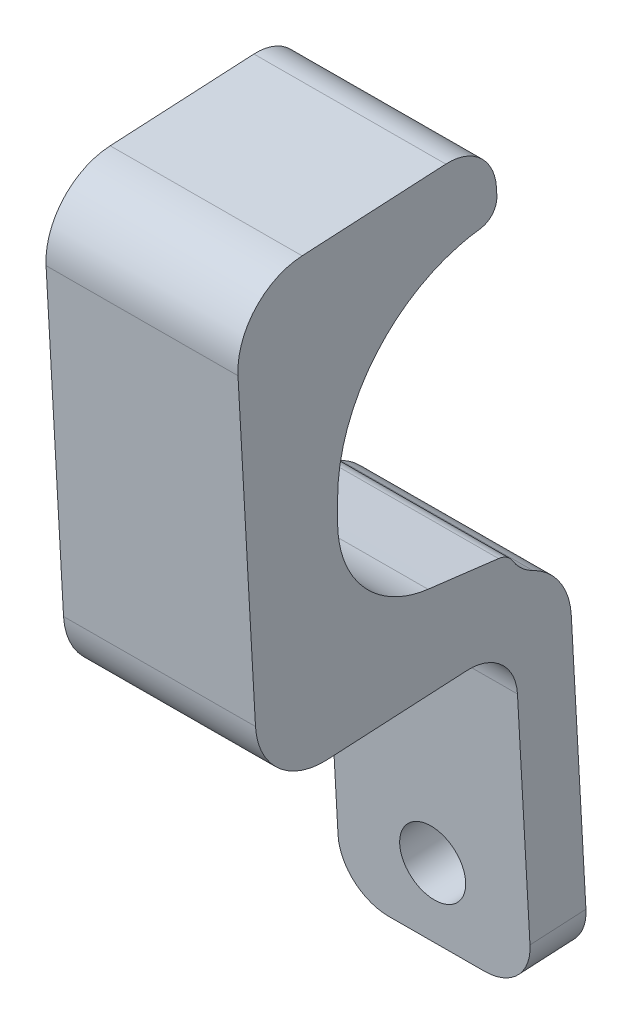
ISO-10303-21;
HEADER;
FILE_DESCRIPTION(('STEP AP214'),'2;1');
FILE_NAME('part.step','',(''),(''),'','','');
FILE_SCHEMA(('AUTOMOTIVE_DESIGN { 1 0 10303 214 1 1 1 1 }'));
ENDSEC;
DATA;
#1=APPLICATION_CONTEXT('core data for automotive mechanical design processes');
#2=APPLICATION_PROTOCOL_DEFINITION('international standard','automotive_design',2000,#1);
#3=PRODUCT_CONTEXT('',#1,'mechanical');
#4=PRODUCT('Part','Part','',(#3));
#5=PRODUCT_RELATED_PRODUCT_CATEGORY('part','',(#4));
#6=PRODUCT_DEFINITION_FORMATION('','',#4);
#7=PRODUCT_DEFINITION_CONTEXT('part definition',#1,'design');
#8=PRODUCT_DEFINITION('design','',#6,#7);
#9=PRODUCT_DEFINITION_SHAPE('','',#8);
#10=(LENGTH_UNIT() NAMED_UNIT(*) SI_UNIT(.MILLI.,.METRE.));
#11=(NAMED_UNIT(*) PLANE_ANGLE_UNIT() SI_UNIT($,.RADIAN.));
#12=(NAMED_UNIT(*) SI_UNIT($,.STERADIAN.) SOLID_ANGLE_UNIT());
#13=UNCERTAINTY_MEASURE_WITH_UNIT(LENGTH_MEASURE(1.E-05),#10,'distance_accuracy_value','');
#14=(GEOMETRIC_REPRESENTATION_CONTEXT(3) GLOBAL_UNCERTAINTY_ASSIGNED_CONTEXT((#13)) GLOBAL_UNIT_ASSIGNED_CONTEXT((#10,
#11,#12)) REPRESENTATION_CONTEXT('',''));
#15=CARTESIAN_POINT('',(0.,0.,0.));
#16=DIRECTION('',(0.,0.,1.));
#17=DIRECTION('',(1.,0.,0.));
#18=AXIS2_PLACEMENT_3D('',#15,#16,#17);
#19=CARTESIAN_POINT('',(-834.65439180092,-555.791109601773,28.1914767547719));
#20=CARTESIAN_POINT('',(-834.654415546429,-555.784341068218,28.2458345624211));
#21=CARTESIAN_POINT('',(-834.654439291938,-555.777572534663,28.3001923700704));
#22=CARTESIAN_POINT('',(-834.654509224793,-555.757638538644,28.4602814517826));
#23=CARTESIAN_POINT('',(-834.654602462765,-555.731061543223,28.6737178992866));
#24=CARTESIAN_POINT('',(-834.654819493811,-555.669348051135,29.026064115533));
#25=CARTESIAN_POINT('',(-834.655053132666,-555.602955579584,29.3634905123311));
#26=CARTESIAN_POINT('',(-834.65532421,-555.525979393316,29.7019723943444));
#27=CARTESIAN_POINT('',(-834.65563262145,-555.438449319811,30.0411943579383));
#28=CARTESIAN_POINT('',(-834.655979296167,-555.340103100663,30.3807890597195));
#29=CARTESIAN_POINT('',(-834.656364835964,-555.230771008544,30.7203851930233));
#30=CARTESIAN_POINT('',(-834.65678988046,-555.110272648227,31.0595941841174));
#31=CARTESIAN_POINT('',(-834.657255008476,-554.978444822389,31.3980154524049));
#32=CARTESIAN_POINT('',(-834.657760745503,-554.835139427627,31.7352296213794));
#33=CARTESIAN_POINT('',(-834.658307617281,-554.680208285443,32.0708217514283));
#34=CARTESIAN_POINT('',(-834.65971874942,-554.280497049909,32.8707259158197));
#35=CARTESIAN_POINT('',(-834.662690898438,-553.438974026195,34.2135908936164));
#36=CARTESIAN_POINT('',(-834.668483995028,-551.799598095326,36.0035617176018));
#37=CARTESIAN_POINT('',(-834.675108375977,-549.925750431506,37.307536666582));
#38=CARTESIAN_POINT('',(-834.68066026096,-548.35567634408,38.0199587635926));
#39=CARTESIAN_POINT('',(-834.684071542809,-547.391075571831,38.3514565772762));
#40=CARTESIAN_POINT('',(-834.686712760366,-546.644280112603,38.5543046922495));
#41=CARTESIAN_POINT('',(-834.689290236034,-545.91555780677,38.7037890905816));
#42=CARTESIAN_POINT('',(-834.691790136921,-545.208814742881,38.8037718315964));
#43=CARTESIAN_POINT('',(-834.694458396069,-544.454514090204,38.8732208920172));
#44=CARTESIAN_POINT('',(-834.695871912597,-544.054959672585,38.8733154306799));
#45=CARTESIAN_POINT('',(-834.696728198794,-543.812915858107,38.8733722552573));
#46=CARTESIAN_POINT('',(-834.696907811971,-543.762145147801,38.8733841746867));
#47=CARTESIAN_POINT('',(-834.697087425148,-543.711374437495,38.8733960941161));
#48=B_SPLINE_CURVE_WITH_KNOTS('',3,(#19,#20,#21,#22,#23,#24,#25,#26,#27,#28,#29,#30,#31,#32,#33,
#34,#35,#36,#37,#38,#39,#40,#41,#42,#43,#44,#45,#46,#47),.UNSPECIFIED.,.F.,.F.,(4,2,1,1,1,1,1,1,
1,1,1,1,1,1,1,1,1,1,1,1,1,1,1,2,4),(-0.01,0.,0.0194509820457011,0.0390871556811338,
0.0589085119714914,0.0789150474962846,0.0991067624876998,0.119483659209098,0.140045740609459,
0.160793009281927,0.181725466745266,0.202843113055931,0.224145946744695,0.245633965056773,
0.357473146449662,0.49687184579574,0.662690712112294,0.748066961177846,0.794370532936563,
0.838948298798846,0.881800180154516,0.922926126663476,0.962326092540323,1.,1.01),.UNSPECIFIED.);
#49=DIRECTION('',(-0.999993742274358,-0.00353771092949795,3.67481384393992E-06));
#50=VECTOR('',#49,1.);
#51=SURFACE_OF_LINEAR_EXTRUSION('',#48,#50);
#52=OFFSET_SURFACE('',#51,1.5875,.F.);
#53=CARTESIAN_POINT('',(-860.048730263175,-557.435994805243,28.5507335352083));
#54=CARTESIAN_POINT('',(-860.04874632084,-557.431417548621,28.5875913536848));
#55=CARTESIAN_POINT('',(-860.048762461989,-557.4268166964,28.6244470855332));
#56=CARTESIAN_POINT('',(-860.048795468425,-557.417410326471,28.6981346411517));
#57=CARTESIAN_POINT('',(-860.048812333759,-557.412604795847,28.7349664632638));
#58=CARTESIAN_POINT('',(-860.048847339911,-557.40263325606,28.8085735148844));
#59=CARTESIAN_POINT('',(-860.048865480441,-557.39746732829,28.845348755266));
#60=CARTESIAN_POINT('',(-860.048903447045,-557.38665909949,28.9188280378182));
#61=CARTESIAN_POINT('',(-860.048923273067,-557.381016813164,28.9555320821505));
#62=CARTESIAN_POINT('',(-860.048985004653,-557.363453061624,29.0655447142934));
#63=CARTESIAN_POINT('',(-860.049029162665,-557.350895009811,29.1387515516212));
#64=CARTESIAN_POINT('',(-860.049098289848,-557.33124112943,29.2484161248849));
#65=CARTESIAN_POINT('',(-860.049121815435,-557.324553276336,29.2849488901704));
#66=CARTESIAN_POINT('',(-860.049169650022,-557.310956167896,29.357973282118));
#67=CARTESIAN_POINT('',(-860.049193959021,-557.304046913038,29.3944649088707));
#68=CARTESIAN_POINT('',(-860.049268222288,-557.282941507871,29.503863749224));
#69=CARTESIAN_POINT('',(-860.049319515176,-557.268367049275,29.5766986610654));
#70=CARTESIAN_POINT('',(-860.049426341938,-557.238019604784,29.7221189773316));
#71=CARTESIAN_POINT('',(-860.049481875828,-557.222246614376,29.794704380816));
#72=CARTESIAN_POINT('',(-860.049597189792,-557.189500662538,29.9396011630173));
#73=CARTESIAN_POINT('',(-860.049656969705,-557.172527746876,30.0119125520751));
#74=CARTESIAN_POINT('',(-860.049780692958,-557.137405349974,30.1562486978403));
#75=CARTESIAN_POINT('',(-860.049844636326,-557.119255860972,30.2282734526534));
#76=CARTESIAN_POINT('',(-860.050042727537,-557.063038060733,30.4438911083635));
#77=CARTESIAN_POINT('',(-860.050183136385,-557.023200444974,30.5870272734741));
#78=CARTESIAN_POINT('',(-860.050480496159,-556.93885075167,30.8719176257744));
#79=CARTESIAN_POINT('',(-860.050637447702,-556.894338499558,31.0136717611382));
#80=CARTESIAN_POINT('',(-860.050967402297,-556.800778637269,31.2953776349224));
#81=CARTESIAN_POINT('',(-860.051140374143,-556.751739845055,31.4353322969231));
#82=CARTESIAN_POINT('',(-860.051502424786,-556.649111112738,31.7135532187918));
#83=CARTESIAN_POINT('',(-860.051691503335,-556.595521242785,31.8518195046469));
#84=CARTESIAN_POINT('',(-860.052282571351,-556.428017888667,32.2638482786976));
#85=CARTESIAN_POINT('',(-860.052708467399,-556.307349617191,32.5349040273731));
#86=CARTESIAN_POINT('',(-860.053622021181,-556.04856398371,33.0684544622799));
#87=CARTESIAN_POINT('',(-860.054109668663,-555.910449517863,33.3309505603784));
#88=CARTESIAN_POINT('',(-860.055294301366,-555.574980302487,33.9208632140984));
#89=CARTESIAN_POINT('',(-860.056011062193,-555.372038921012,34.2451247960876));
#90=CARTESIAN_POINT('',(-860.057538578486,-554.93960598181,34.8753607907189));
#91=CARTESIAN_POINT('',(-860.058349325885,-554.710116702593,35.181336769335));
#92=CARTESIAN_POINT('',(-860.060058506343,-554.226373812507,35.7725901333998));
#93=CARTESIAN_POINT('',(-860.06095685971,-553.972142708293,36.0578859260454));
#94=CARTESIAN_POINT('',(-860.062835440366,-553.440560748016,36.6060521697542));
#95=CARTESIAN_POINT('',(-860.063815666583,-553.163210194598,36.8689229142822));
#96=CARTESIAN_POINT('',(-860.065850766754,-552.5874340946,37.3701628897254));
#97=CARTESIAN_POINT('',(-860.066905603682,-552.289019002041,37.6085441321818));
#98=CARTESIAN_POINT('',(-860.06908234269,-551.673258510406,38.059514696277));
#99=CARTESIAN_POINT('',(-860.070204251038,-551.355911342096,38.2721016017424));
#100=CARTESIAN_POINT('',(-860.072509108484,-550.703990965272,38.6701672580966));
#101=CARTESIAN_POINT('',(-860.073692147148,-550.369392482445,38.8556046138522));
#102=CARTESIAN_POINT('',(-860.076109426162,-549.685752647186,39.1974524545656));
#103=CARTESIAN_POINT('',(-860.077343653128,-549.336715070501,39.3538704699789));
#104=CARTESIAN_POINT('',(-860.079436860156,-548.744789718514,39.5897615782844));
#105=CARTESIAN_POINT('',(-860.080284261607,-548.505166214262,39.6775321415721));
#106=CARTESIAN_POINT('',(-860.081995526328,-548.021280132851,39.8394626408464));
#107=CARTESIAN_POINT('',(-860.082859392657,-547.777016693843,39.913620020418));
#108=CARTESIAN_POINT('',(-860.08416543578,-547.407736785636,40.0144728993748));
#109=CARTESIAN_POINT('',(-860.08460265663,-547.284115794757,40.0463700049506));
#110=CARTESIAN_POINT('',(-860.08548012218,-547.036022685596,40.1066844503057));
#111=CARTESIAN_POINT('',(-860.085920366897,-546.911550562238,40.1351017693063));
#112=CARTESIAN_POINT('',(-860.086802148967,-546.66224467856,40.1883281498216));
#113=CARTESIAN_POINT('',(-860.087243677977,-546.53741326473,40.2131482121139));
#114=CARTESIAN_POINT('',(-860.088129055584,-546.287098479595,40.2592143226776));
#115=CARTESIAN_POINT('',(-860.08857290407,-546.161615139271,40.2804605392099));
#116=CARTESIAN_POINT('',(-860.089462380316,-545.910149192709,40.3194139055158));
#117=CARTESIAN_POINT('',(-860.08990800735,-545.784166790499,40.3371223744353));
#118=CARTESIAN_POINT('',(-860.090577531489,-545.594889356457,40.3613133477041));
#119=CARTESIAN_POINT('',(-860.090800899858,-545.531742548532,40.3689820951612));
#120=CARTESIAN_POINT('',(-860.091247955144,-545.405359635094,40.3836019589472));
#121=CARTESIAN_POINT('',(-860.091471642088,-545.342123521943,40.3905530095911));
#122=CARTESIAN_POINT('',(-860.091919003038,-545.215655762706,40.4036756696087));
#123=CARTESIAN_POINT('',(-860.09214267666,-545.152424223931,40.4098483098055));
#124=CARTESIAN_POINT('',(-860.092590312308,-545.025880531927,40.4213197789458));
#125=CARTESIAN_POINT('',(-860.092814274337,-544.962568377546,40.4266185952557));
#126=CARTESIAN_POINT('',(-860.093262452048,-544.835873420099,40.4362052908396));
#127=CARTESIAN_POINT('',(-860.093486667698,-544.772490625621,40.4404932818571));
#128=CARTESIAN_POINT('',(-860.093935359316,-544.645652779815,40.447792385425));
#129=CARTESIAN_POINT('',(-860.094159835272,-544.58219773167,40.4508035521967));
#130=CARTESIAN_POINT('',(-860.094550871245,-544.471660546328,40.4549077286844));
#131=CARTESIAN_POINT('',(-860.094717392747,-544.424588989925,40.4562954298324));
#132=CARTESIAN_POINT('',(-860.095050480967,-544.330433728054,40.4584624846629));
#133=CARTESIAN_POINT('',(-860.095217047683,-544.283350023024,40.4592418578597));
#134=CARTESIAN_POINT('',(-860.095550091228,-544.189208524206,40.4603159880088));
#135=CARTESIAN_POINT('',(-860.095716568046,-544.142150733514,40.460611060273));
#136=CARTESIAN_POINT('',(-860.096049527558,-544.048033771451,40.4609313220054));
#137=CARTESIAN_POINT('',(-860.096216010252,-544.000974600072,40.4609565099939));
#138=CARTESIAN_POINT('',(-860.096382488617,-543.953916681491,40.4609536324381));
#139=B_SPLINE_CURVE_WITH_KNOTS('',3,(#53,#54,#55,#56,#57,#58,#59,#60,#61,#62,#63,#64,#65,#66,
#67,#68,#69,#70,#71,#72,#73,#74,#75,#76,#77,#78,#79,#80,#81,#82,#83,#84,#85,#86,#87,#88,#89,#90,
#91,#92,#93,#94,#95,#96,#97,#98,#99,#100,#101,#102,#103,#104,#105,#106,#107,#108,#109,#110,#111,
#112,#113,#114,#115,#116,#117,#118,#119,#120,#121,#122,#123,#124,#125,#126,#127,#128,#129,#130,
#131,#132,#133,#134,#135,#136,#137,#138),.UNSPECIFIED.,.F.,.F.,(4,2,2,2,2,2,2,2,2,2,2,2,2,2,2,2,
2,2,2,2,2,2,2,2,2,2,2,2,2,2,2,2,2,2,2,2,2,2,2,2,2,2,4),(0.,0.111424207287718,0.222855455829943,
0.334261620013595,0.445664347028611,0.668476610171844,0.779896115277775,0.891315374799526,
1.114142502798,1.33697046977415,1.55978994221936,1.78261088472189,2.22825316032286,
2.67391208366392,3.11872045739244,3.56352197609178,4.45292515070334,5.34218087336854,
6.48836027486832,7.63444137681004,8.77948950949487,9.92452265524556,11.068991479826,
12.2135674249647,13.3598707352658,14.5058761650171,15.2711006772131,16.0364687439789,
16.419440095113,16.8024137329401,17.1841903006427,17.565948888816,17.9475648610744,
18.1383951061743,18.3292428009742,18.5198350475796,18.7104300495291,18.901003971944,
19.0915698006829,19.2328422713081,19.3741102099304,19.515286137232,19.6564628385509),.UNSPECIFIED.);
#140=CARTESIAN_POINT('',(-860.048730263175,-557.435994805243,28.5507335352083));
#141=VERTEX_POINT('',#140);
#142=CARTESIAN_POINT('',(-860.096382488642,-543.953916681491,40.460953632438));
#143=VERTEX_POINT('',#142);
#144=EDGE_CURVE('E220',#141,#143,#139,.T.);
#145=ORIENTED_EDGE('',*,*,#144,.T.);
#146=DIRECTION('',(-0.999993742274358,-0.00353771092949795,3.67481384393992E-06));
#147=VECTOR('',#146,1.);
#148=CARTESIAN_POINT('',(-834.696541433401,-543.864059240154,40.4608602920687));
#149=LINE('',#148,#147);
#150=CARTESIAN_POINT('',(-834.696541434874,-543.864058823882,40.4608602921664));
#151=VERTEX_POINT('',#150);
#152=EDGE_CURVE('E349',#151,#143,#149,.T.);
#153=ORIENTED_EDGE('',*,*,#152,.F.);
#154=CARTESIAN_POINT('',(-834.648889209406,-557.346136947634,28.5506401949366));
#155=CARTESIAN_POINT('',(-834.648905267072,-557.341559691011,28.5874980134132));
#156=CARTESIAN_POINT('',(-834.64892140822,-557.336958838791,28.6243537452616));
#157=CARTESIAN_POINT('',(-834.648954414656,-557.327552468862,28.69804130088));
#158=CARTESIAN_POINT('',(-834.64897127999,-557.322746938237,28.7348731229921));
#159=CARTESIAN_POINT('',(-834.649006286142,-557.312775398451,28.8084801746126));
#160=CARTESIAN_POINT('',(-834.649024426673,-557.307609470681,28.8452554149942));
#161=CARTESIAN_POINT('',(-834.649062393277,-557.296801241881,28.9187346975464));
#162=CARTESIAN_POINT('',(-834.649082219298,-557.291158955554,28.9554387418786));
#163=CARTESIAN_POINT('',(-834.649143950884,-557.273595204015,29.0654513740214));
#164=CARTESIAN_POINT('',(-834.649188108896,-557.261037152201,29.1386582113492));
#165=CARTESIAN_POINT('',(-834.649257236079,-557.241383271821,29.2483227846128));
#166=CARTESIAN_POINT('',(-834.649280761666,-557.234695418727,29.2848555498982));
#167=CARTESIAN_POINT('',(-834.649328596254,-557.221098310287,29.3578799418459));
#168=CARTESIAN_POINT('',(-834.649352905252,-557.214189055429,29.3943715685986));
#169=CARTESIAN_POINT('',(-834.649427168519,-557.193083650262,29.5037704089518));
#170=CARTESIAN_POINT('',(-834.649478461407,-557.178509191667,29.5766053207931));
#171=CARTESIAN_POINT('',(-834.649585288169,-557.148161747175,29.7220256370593));
#172=CARTESIAN_POINT('',(-834.649640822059,-557.132388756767,29.7946110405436));
#173=CARTESIAN_POINT('',(-834.649756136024,-557.099642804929,29.9395078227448));
#174=CARTESIAN_POINT('',(-834.649815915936,-557.082669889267,30.0118192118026));
#175=CARTESIAN_POINT('',(-834.649939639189,-557.047547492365,30.1561553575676));
#176=CARTESIAN_POINT('',(-834.650003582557,-557.029398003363,30.2281801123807));
#177=CARTESIAN_POINT('',(-834.650201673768,-556.973180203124,30.4437977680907));
#178=CARTESIAN_POINT('',(-834.650342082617,-556.933342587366,30.5869339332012));
#179=CARTESIAN_POINT('',(-834.65063944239,-556.848992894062,30.8718242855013));
#180=CARTESIAN_POINT('',(-834.650796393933,-556.804480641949,31.013578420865));
#181=CARTESIAN_POINT('',(-834.651126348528,-556.71092077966,31.295284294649));
#182=CARTESIAN_POINT('',(-834.651299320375,-556.661881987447,31.4352389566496));
#183=CARTESIAN_POINT('',(-834.651661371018,-556.559253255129,31.7134598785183));
#184=CARTESIAN_POINT('',(-834.651850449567,-556.505663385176,31.8517261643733));
#185=CARTESIAN_POINT('',(-834.652441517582,-556.338160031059,32.2637549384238));
#186=CARTESIAN_POINT('',(-834.652867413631,-556.217491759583,32.5348106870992));
#187=CARTESIAN_POINT('',(-834.653780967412,-555.958706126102,33.0683611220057));
#188=CARTESIAN_POINT('',(-834.654268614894,-555.820591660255,33.3308572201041));
#189=CARTESIAN_POINT('',(-834.655453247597,-555.485122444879,33.920769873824));
#190=CARTESIAN_POINT('',(-834.656170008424,-555.282181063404,34.2450314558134));
#191=CARTESIAN_POINT('',(-834.657697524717,-554.849748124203,34.875267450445));
#192=CARTESIAN_POINT('',(-834.658508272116,-554.620258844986,35.1812434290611));
#193=CARTESIAN_POINT('',(-834.660217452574,-554.136515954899,35.772496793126));
#194=CARTESIAN_POINT('',(-834.661115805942,-553.882284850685,36.0577925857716));
#195=CARTESIAN_POINT('',(-834.662994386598,-553.350702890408,36.6059588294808));
#196=CARTESIAN_POINT('',(-834.663974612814,-553.073352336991,36.868829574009));
#197=CARTESIAN_POINT('',(-834.666009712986,-552.497576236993,37.3700695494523));
#198=CARTESIAN_POINT('',(-834.667064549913,-552.199161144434,37.6084507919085));
#199=CARTESIAN_POINT('',(-834.669241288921,-551.583400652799,38.0594213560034));
#200=CARTESIAN_POINT('',(-834.670363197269,-551.266053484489,38.2720082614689));
#201=CARTESIAN_POINT('',(-834.672668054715,-550.614133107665,38.6700739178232));
#202=CARTESIAN_POINT('',(-834.673851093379,-550.279534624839,38.8555112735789));
#203=CARTESIAN_POINT('',(-834.676268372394,-549.595894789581,39.1973591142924));
#204=CARTESIAN_POINT('',(-834.677502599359,-549.246857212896,39.3537771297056));
#205=CARTESIAN_POINT('',(-834.679595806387,-548.654931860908,39.5896682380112));
#206=CARTESIAN_POINT('',(-834.680443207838,-548.415308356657,39.6774388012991));
#207=CARTESIAN_POINT('',(-834.68215447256,-547.931422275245,39.8393693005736));
#208=CARTESIAN_POINT('',(-834.683018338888,-547.687158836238,39.9135266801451));
#209=CARTESIAN_POINT('',(-834.684324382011,-547.317878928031,40.0143795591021));
#210=CARTESIAN_POINT('',(-834.684761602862,-547.194257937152,40.046276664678));
#211=CARTESIAN_POINT('',(-834.685639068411,-546.946164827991,40.1065911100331));
#212=CARTESIAN_POINT('',(-834.686079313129,-546.821692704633,40.1350084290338));
#213=CARTESIAN_POINT('',(-834.686961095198,-546.572386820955,40.1882348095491));
#214=CARTESIAN_POINT('',(-834.687402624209,-546.447555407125,40.2130548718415));
#215=CARTESIAN_POINT('',(-834.688288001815,-546.19724062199,40.2591209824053));
#216=CARTESIAN_POINT('',(-834.688731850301,-546.071757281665,40.2803671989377));
#217=CARTESIAN_POINT('',(-834.689621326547,-545.820291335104,40.3193205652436));
#218=CARTESIAN_POINT('',(-834.690066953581,-545.694308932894,40.3370290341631));
#219=CARTESIAN_POINT('',(-834.69073647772,-545.505031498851,40.361220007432));
#220=CARTESIAN_POINT('',(-834.690959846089,-545.441884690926,40.3688887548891));
#221=CARTESIAN_POINT('',(-834.691406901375,-545.315501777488,40.3835086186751));
#222=CARTESIAN_POINT('',(-834.69163058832,-545.252265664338,40.390459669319));
#223=CARTESIAN_POINT('',(-834.692077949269,-545.1257979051,40.4035823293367));
#224=CARTESIAN_POINT('',(-834.692301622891,-545.062566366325,40.4097549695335));
#225=CARTESIAN_POINT('',(-834.692749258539,-544.936022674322,40.4212264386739));
#226=CARTESIAN_POINT('',(-834.692973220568,-544.872710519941,40.4265252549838));
#227=CARTESIAN_POINT('',(-834.693421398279,-544.746015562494,40.4361119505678));
#228=CARTESIAN_POINT('',(-834.693645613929,-544.682632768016,40.4403999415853));
#229=CARTESIAN_POINT('',(-834.694094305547,-544.55579492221,40.4476990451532));
#230=CARTESIAN_POINT('',(-834.694318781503,-544.492339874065,40.4507102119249));
#231=CARTESIAN_POINT('',(-834.694709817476,-544.381802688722,40.4548143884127));
#232=CARTESIAN_POINT('',(-834.694876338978,-544.334731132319,40.4562020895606));
#233=CARTESIAN_POINT('',(-834.695209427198,-544.240575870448,40.4583691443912));
#234=CARTESIAN_POINT('',(-834.695375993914,-544.193492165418,40.459148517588));
#235=CARTESIAN_POINT('',(-834.69570903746,-544.099350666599,40.4602226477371));
#236=CARTESIAN_POINT('',(-834.695875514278,-544.052292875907,40.4605177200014));
#237=CARTESIAN_POINT('',(-834.696208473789,-543.958175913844,40.4608379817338));
#238=CARTESIAN_POINT('',(-834.696374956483,-543.911116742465,40.4608631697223));
#239=CARTESIAN_POINT('',(-834.696541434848,-543.864058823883,40.4608602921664));
#240=B_SPLINE_CURVE_WITH_KNOTS('',3,(#154,#155,#156,#157,#158,#159,#160,#161,#162,#163,#164,
#165,#166,#167,#168,#169,#170,#171,#172,#173,#174,#175,#176,#177,#178,#179,#180,#181,#182,#183,
#184,#185,#186,#187,#188,#189,#190,#191,#192,#193,#194,#195,#196,#197,#198,#199,#200,#201,#202,
#203,#204,#205,#206,#207,#208,#209,#210,#211,#212,#213,#214,#215,#216,#217,#218,#219,#220,#221,
#222,#223,#224,#225,#226,#227,#228,#229,#230,#231,#232,#233,#234,#235,#236,#237,#238,#239),
.UNSPECIFIED.,.F.,.F.,(4,2,2,2,2,2,2,2,2,2,2,2,2,2,2,2,2,2,2,2,2,2,2,2,2,2,2,2,2,2,2,2,2,2,2,2,
2,2,2,2,2,2,4),(0.,0.111424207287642,0.222855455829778,0.334261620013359,0.445664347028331,
0.668476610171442,0.779896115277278,0.891315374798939,1.1141425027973,1.3369704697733,
1.55978994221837,1.78261088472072,2.22825316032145,2.67391208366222,3.1187204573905,
3.56352197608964,4.45292515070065,5.34218087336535,6.48836027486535,7.63444137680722,
8.77948950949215,9.92452265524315,11.0689914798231,12.2135674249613,13.3598707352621,
14.5058761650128,15.2711006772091,16.0364687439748,16.4194400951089,16.802413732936,
17.1841903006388,17.5659488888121,17.9475648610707,18.1383951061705,18.3292428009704,
18.5198350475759,18.7104300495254,18.9010039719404,19.0915698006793,19.232842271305,
19.3741102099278,19.5152861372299,19.6564628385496),.UNSPECIFIED.);
#241=CARTESIAN_POINT('',(-834.648889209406,-557.346136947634,28.5506401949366));
#242=VERTEX_POINT('',#241);
#243=EDGE_CURVE('E315',#242,#151,#240,.T.);
#244=ORIENTED_EDGE('',*,*,#243,.F.);
#245=DIRECTION('',(-0.999993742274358,-0.00353771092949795,3.67481384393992E-06));
#246=VECTOR('',#245,1.);
#247=CARTESIAN_POINT('',(-834.648889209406,-557.346136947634,28.5506401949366));
#248=LINE('',#247,#246);
#249=EDGE_CURVE('E490',#242,#141,#248,.T.);
#250=ORIENTED_EDGE('',*,*,#249,.T.);
#251=EDGE_LOOP('',(#145,#153,#244,#250));
#252=FACE_BOUND('',#251,.T.);
#253=ADVANCED_FACE('F66',(#252),#52,.F.);
#254=CARTESIAN_POINT('',(-834.706490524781,-541.051779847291,40.4615197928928));
#255=DIRECTION('',(4.50440554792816E-06,-0.000234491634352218,0.999999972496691));
#256=DIRECTION('',(0.,-0.999999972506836,-0.000234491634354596));
#257=AXIS2_PLACEMENT_3D('',#254,#255,#256);
#258=PLANE('',#257);
#259=DIRECTION('',(-0.00353770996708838,0.999993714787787,0.00023450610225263));
#260=VECTOR('',#259,1.);
#261=CARTESIAN_POINT('',(-860.106331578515,-541.141637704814,40.4616131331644));
#262=LINE('',#261,#260);
#263=CARTESIAN_POINT('',(-860.10633157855,-541.141637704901,40.4616131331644));
#264=VERTEX_POINT('',#263);
#265=EDGE_CURVE('E480',#143,#264,#262,.T.);
#266=ORIENTED_EDGE('',*,*,#265,.T.);
#267=DIRECTION('',(-0.999993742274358,-0.00353771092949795,3.67481384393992E-06));
#268=VECTOR('',#267,1.);
#269=CARTESIAN_POINT('',(-834.706490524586,-541.051779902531,40.4615197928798));
#270=LINE('',#269,#268);
#271=CARTESIAN_POINT('',(-834.706490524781,-541.051779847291,40.4615197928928));
#272=VERTEX_POINT('',#271);
#273=EDGE_CURVE('E487',#272,#264,#270,.T.);
#274=ORIENTED_EDGE('',*,*,#273,.F.);
#275=DIRECTION('',(-0.00353770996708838,0.999993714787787,0.00023450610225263));
#276=VECTOR('',#275,1.);
#277=CARTESIAN_POINT('',(-834.706490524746,-541.051779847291,40.4615197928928));
#278=LINE('',#277,#276);
#279=EDGE_CURVE('E323',#151,#272,#278,.T.);
#280=ORIENTED_EDGE('',*,*,#279,.F.);
#281=ORIENTED_EDGE('',*,*,#152,.T.);
#282=EDGE_LOOP('',(#266,#274,#280,#281));
#283=FACE_BOUND('',#282,.T.);
#284=ADVANCED_FACE('F300',(#283),#258,.F.);
#285=CARTESIAN_POINT('',(-834.706497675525,-541.051407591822,38.8740198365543));
#286=CARTESIAN_POINT('',(-834.707061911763,-540.89191665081,38.8740572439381));
#287=CARTESIAN_POINT('',(-834.708185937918,-540.574195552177,38.8703243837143));
#288=CARTESIAN_POINT('',(-834.709648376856,-540.160827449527,38.8559203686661));
#289=CARTESIAN_POINT('',(-834.711213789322,-539.718362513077,38.8315304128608));
#290=CARTESIAN_POINT('',(-834.712770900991,-539.27825415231,38.7973063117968));
#291=CARTESIAN_POINT('',(-834.714318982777,-538.840708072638,38.7536171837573));
#292=CARTESIAN_POINT('',(-834.715857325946,-538.405924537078,38.7005323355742));
#293=CARTESIAN_POINT('',(-834.7173852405,-537.974098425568,38.6382057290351));
#294=CARTESIAN_POINT('',(-834.718902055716,-537.545419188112,38.5667732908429));
#295=CARTESIAN_POINT('',(-834.720407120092,-537.120070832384,38.4863800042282));
#296=CARTESIAN_POINT('',(-834.721899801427,-536.698231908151,38.3971724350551));
#297=CARTESIAN_POINT('',(-834.723379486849,-536.280075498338,38.2993004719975));
#298=CARTESIAN_POINT('',(-834.724845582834,-535.865769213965,38.1929166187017));
#299=CARTESIAN_POINT('',(-834.726297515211,-535.45547519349,38.0781759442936));
#300=CARTESIAN_POINT('',(-834.727734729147,-535.049350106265,37.9552358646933));
#301=CARTESIAN_POINT('',(-834.729156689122,-534.647545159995,37.8242559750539));
#302=CARTESIAN_POINT('',(-834.730562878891,-534.250206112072,37.6853978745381));
#303=CARTESIAN_POINT('',(-834.731952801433,-533.857473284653,37.5388249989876));
#304=CARTESIAN_POINT('',(-834.73332597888,-533.469481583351,37.384702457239));
#305=CARTESIAN_POINT('',(-834.734681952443,-533.086360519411,37.2231968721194));
#306=CARTESIAN_POINT('',(-834.736020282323,-532.70823423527,37.0544762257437));
#307=CARTESIAN_POINT('',(-834.737340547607,-532.335221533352,36.8787097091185));
#308=CARTESIAN_POINT('',(-834.738642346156,-531.967435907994,36.6960675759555));
#309=CARTESIAN_POINT('',(-834.739925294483,-531.604985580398,36.5067210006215));
#310=CARTESIAN_POINT('',(-834.74118902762,-531.247973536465,36.3108419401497));
#311=CARTESIAN_POINT('',(-834.742433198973,-530.89649756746,36.1086030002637));
#312=CARTESIAN_POINT('',(-834.743657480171,-530.550650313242,35.9001773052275));
#313=CARTESIAN_POINT('',(-834.744861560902,-530.210519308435,35.6857383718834));
#314=CARTESIAN_POINT('',(-834.746045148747,-529.876187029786,35.4654599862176));
#315=CARTESIAN_POINT('',(-834.747207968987,-529.54773095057,35.2395160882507));
#316=CARTESIAN_POINT('',(-834.748349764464,-529.225223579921,35.0080806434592));
#317=CARTESIAN_POINT('',(-834.749470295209,-528.908732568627,34.7713275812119));
#318=CARTESIAN_POINT('',(-834.750569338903,-528.59832057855,34.5294305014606));
#319=CARTESIAN_POINT('',(-834.751646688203,-528.294046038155,34.282563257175));
#320=CARTESIAN_POINT('',(-834.752702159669,-527.995960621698,34.0308973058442));
#321=CARTESIAN_POINT('',(-834.754135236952,-527.591246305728,33.6754899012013));
#322=CARTESIAN_POINT('',(-834.755917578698,-527.087925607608,33.2054095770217));
#323=CARTESIAN_POINT('',(-834.758004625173,-526.498608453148,32.6068278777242));
#324=CARTESIAN_POINT('',(-834.760006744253,-525.933324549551,31.9821684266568));
#325=CARTESIAN_POINT('',(-834.761919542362,-525.393314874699,31.3323367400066));
#326=CARTESIAN_POINT('',(-834.763738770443,-524.879779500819,30.6582911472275));
#327=CARTESIAN_POINT('',(-834.765460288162,-524.393887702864,29.9610525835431));
#328=CARTESIAN_POINT('',(-834.767080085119,-523.936771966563,29.2417005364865));
#329=CARTESIAN_POINT('',(-834.768594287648,-523.509526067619,28.5013726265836));
#330=CARTESIAN_POINT('',(-834.769999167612,-523.113202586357,27.7412630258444));
#331=CARTESIAN_POINT('',(-834.77129115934,-522.748808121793,26.9626213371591));
#332=CARTESIAN_POINT('',(-834.772466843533,-522.417307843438,26.166750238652));
#333=CARTESIAN_POINT('',(-834.773523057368,-522.119594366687,25.3550070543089));
#334=CARTESIAN_POINT('',(-834.774456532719,-521.856590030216,24.5287902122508));
#335=CARTESIAN_POINT('',(-834.775265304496,-521.628848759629,23.6895818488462));
#336=CARTESIAN_POINT('',(-834.775943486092,-521.438033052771,22.8387794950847));
#337=CARTESIAN_POINT('',(-834.77648441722,-521.286002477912,21.9985962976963));
#338=CARTESIAN_POINT('',(-834.776769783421,-521.205953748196,21.4066890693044));
#339=CARTESIAN_POINT('',(-834.776889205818,-521.172506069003,21.1091420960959));
#340=B_SPLINE_CURVE_WITH_KNOTS('',3,(#285,#286,#287,#288,#289,#290,#291,#292,#293,#294,#295,
#296,#297,#298,#299,#300,#301,#302,#303,#304,#305,#306,#307,#308,#309,#310,#311,#312,#313,#314,
#315,#316,#317,#318,#319,#320,#321,#322,#323,#324,#325,#326,#327,#328,#329,#330,#331,#332,#333,
#334,#335,#336,#337,#338,#339),.UNSPECIFIED.,.F.,.F.,(4,1,1,1,1,1,1,1,1,1,1,1,1,1,1,1,1,1,1,1,1,
1,1,1,1,1,1,1,1,1,1,1,1,1,1,1,1,1,1,1,1,1,1,1,1,1,1,1,1,1,1,1,4),(0.,0.0153030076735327,
0.0305473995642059,0.0457331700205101,0.0608603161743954,0.0759288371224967,0.090938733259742,
0.10589000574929,0.120782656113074,0.135616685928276,0.150392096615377,0.165108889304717,
0.179767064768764,0.194366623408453,0.208907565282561,0.223389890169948,0.237813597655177,
0.252178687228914,0.266485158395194,0.280733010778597,0.294922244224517,0.309052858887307,
0.323124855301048,0.337138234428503,0.351092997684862,0.364989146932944,0.378826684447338,
0.392605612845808,0.406325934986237,0.419987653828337,0.433590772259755,0.447135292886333,
0.460621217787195,0.474048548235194,0.487417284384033,0.500727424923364,0.529422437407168,
0.558201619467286,0.587064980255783,0.616012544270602,0.645044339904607,0.674160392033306,
0.703360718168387,0.732645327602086,0.762014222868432,0.791467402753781,0.821004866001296,
0.850626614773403,0.880332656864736,0.910123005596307,0.939997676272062,0.969956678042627,1.),.UNSPECIFIED.);
#341=DIRECTION('',(-0.999993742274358,-0.00353771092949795,3.67481384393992E-06));
#342=VECTOR('',#341,1.);
#343=SURFACE_OF_LINEAR_EXTRUSION('',#340,#342);
#344=OFFSET_SURFACE('',#343,1.5875,.F.);
#345=CARTESIAN_POINT('',(-860.10633157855,-541.141637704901,40.4616131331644));
#346=CARTESIAN_POINT('',(-860.10651058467,-541.091038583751,40.4616244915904));
#347=CARTESIAN_POINT('',(-860.106689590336,-541.040439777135,40.4614598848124));
#348=CARTESIAN_POINT('',(-860.107047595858,-540.939244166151,40.4607877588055));
#349=CARTESIAN_POINT('',(-860.107226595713,-540.888647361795,40.4602802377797));
#350=CARTESIAN_POINT('',(-860.107763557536,-540.736868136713,40.4582569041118));
#351=CARTESIAN_POINT('',(-860.108121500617,-540.635691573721,40.4562403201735));
#352=CARTESIAN_POINT('',(-860.108837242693,-540.433380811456,40.4506332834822));
#353=CARTESIAN_POINT('',(-860.109195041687,-540.332246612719,40.4470428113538));
#354=CARTESIAN_POINT('',(-860.109910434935,-540.130037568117,40.438436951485));
#355=CARTESIAN_POINT('',(-860.110268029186,-540.028962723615,40.4334215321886));
#356=CARTESIAN_POINT('',(-860.110982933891,-539.826894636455,40.4220597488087));
#357=CARTESIAN_POINT('',(-860.111340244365,-539.725901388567,40.4157134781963));
#358=CARTESIAN_POINT('',(-860.112054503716,-539.524018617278,40.4015644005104));
#359=CARTESIAN_POINT('',(-860.112411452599,-539.423129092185,40.3937616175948));
#360=CARTESIAN_POINT('',(-860.113481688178,-539.120635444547,40.368236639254));
#361=CARTESIAN_POINT('',(-860.11419435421,-538.919208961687,40.3483979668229));
#362=CARTESIAN_POINT('',(-860.11632892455,-538.315907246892,40.28039067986));
#363=CARTESIAN_POINT('',(-860.117747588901,-537.91495666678,40.2237278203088));
#364=CARTESIAN_POINT('',(-860.12057043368,-537.117172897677,40.0880044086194));
#365=CARTESIAN_POINT('',(-860.121974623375,-536.720337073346,40.0089592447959));
#366=CARTESIAN_POINT('',(-860.124765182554,-535.931725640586,39.8286958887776));
#367=CARTESIAN_POINT('',(-860.126151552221,-535.539949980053,39.7274779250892));
#368=CARTESIAN_POINT('',(-860.128901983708,-534.762727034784,39.503202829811));
#369=CARTESIAN_POINT('',(-860.130266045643,-534.377279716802,39.3801458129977));
#370=CARTESIAN_POINT('',(-860.133643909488,-533.422816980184,39.0455833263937));
#371=CARTESIAN_POINT('',(-860.135641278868,-532.858460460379,38.8206318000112));
#372=CARTESIAN_POINT('',(-860.139562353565,-531.750618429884,38.3239252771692));
#373=CARTESIAN_POINT('',(-860.141486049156,-531.20713567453,38.0521641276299));
#374=CARTESIAN_POINT('',(-860.144305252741,-530.410698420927,37.6110073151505));
#375=CARTESIAN_POINT('',(-860.145233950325,-530.1483449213,37.4583654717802));
#376=CARTESIAN_POINT('',(-860.147067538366,-529.630378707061,37.1422046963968));
#377=CARTESIAN_POINT('',(-860.147972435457,-529.37476411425,36.978688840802));
#378=CARTESIAN_POINT('',(-860.150649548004,-528.618559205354,36.4721525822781));
#379=CARTESIAN_POINT('',(-860.15238434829,-528.128561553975,36.1131178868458));
#380=CARTESIAN_POINT('',(-860.155740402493,-527.180703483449,35.3551613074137));
#381=CARTESIAN_POINT('',(-860.157361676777,-526.722837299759,34.9562466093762));
#382=CARTESIAN_POINT('',(-860.160479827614,-525.84230665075,34.1212581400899));
#383=CARTESIAN_POINT('',(-860.161976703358,-525.419642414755,33.6851841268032));
#384=CARTESIAN_POINT('',(-860.164835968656,-524.612364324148,32.7787749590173));
#385=CARTESIAN_POINT('',(-860.16619829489,-524.227768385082,32.3084238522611));
#386=CARTESIAN_POINT('',(-860.168777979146,-523.499586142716,31.3369900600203));
#387=CARTESIAN_POINT('',(-860.169995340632,-523.15599885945,30.8359081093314));
#388=CARTESIAN_POINT('',(-860.172276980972,-522.512124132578,29.8063578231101));
#389=CARTESIAN_POINT('',(-860.17334118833,-522.211856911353,29.2778768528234));
#390=CARTESIAN_POINT('',(-860.175308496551,-521.656886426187,28.1973427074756));
#391=CARTESIAN_POINT('',(-860.176211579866,-521.402188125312,27.645286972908));
#392=CARTESIAN_POINT('',(-860.177439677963,-521.055920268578,26.8031129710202));
#393=CARTESIAN_POINT('',(-860.177827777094,-520.946511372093,26.5201996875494));
#394=CARTESIAN_POINT('',(-860.178561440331,-520.739721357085,25.950007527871));
#395=CARTESIAN_POINT('',(-860.178907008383,-520.64233912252,25.6627290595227));
#396=CARTESIAN_POINT('',(-860.179392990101,-520.505418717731,25.2290024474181));
#397=CARTESIAN_POINT('',(-860.179549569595,-520.46130952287,25.0839789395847));
#398=CARTESIAN_POINT('',(-860.179851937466,-520.376142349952,24.7930417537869));
#399=CARTESIAN_POINT('',(-860.179997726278,-520.335084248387,24.6471281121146));
#400=CARTESIAN_POINT('',(-860.180278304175,-520.256078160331,24.3544764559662));
#401=CARTESIAN_POINT('',(-860.180413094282,-520.218129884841,24.2077385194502));
#402=CARTESIAN_POINT('',(-860.180671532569,-520.145383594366,23.9134859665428));
#403=CARTESIAN_POINT('',(-860.180795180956,-520.110585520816,23.7659713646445));
#404=CARTESIAN_POINT('',(-860.180990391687,-520.055659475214,23.5218671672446));
#405=CARTESIAN_POINT('',(-860.18106506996,-520.034650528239,23.4254746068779));
#406=CARTESIAN_POINT('',(-860.181209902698,-519.993911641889,23.232423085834));
#407=CARTESIAN_POINT('',(-860.181280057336,-519.974181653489,23.1357641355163));
#408=CARTESIAN_POINT('',(-860.181415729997,-519.936032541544,22.9422082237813));
#409=CARTESIAN_POINT('',(-860.181481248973,-519.91761314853,22.8453113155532));
#410=CARTESIAN_POINT('',(-860.181607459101,-519.882139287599,22.6512680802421));
#411=CARTESIAN_POINT('',(-860.181668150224,-519.86508482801,22.5541217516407));
#412=CARTESIAN_POINT('',(-860.181842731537,-519.816039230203,22.2626583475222));
#413=CARTESIAN_POINT('',(-860.181949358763,-519.78610145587,22.0679906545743));
#414=CARTESIAN_POINT('',(-860.182095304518,-519.745151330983,21.7754212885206));
#415=CARTESIAN_POINT('',(-860.182141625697,-519.732159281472,21.6777908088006));
#416=CARTESIAN_POINT('',(-860.182229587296,-519.707498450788,21.4823639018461));
#417=CARTESIAN_POINT('',(-860.182271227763,-519.695829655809,21.3845674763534));
#418=CARTESIAN_POINT('',(-860.182310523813,-519.684823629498,21.2866945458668));
#419=B_SPLINE_CURVE_WITH_KNOTS('',3,(#345,#346,#347,#348,#349,#350,#351,#352,#353,#354,#355,
#356,#357,#358,#359,#360,#361,#362,#363,#364,#365,#366,#367,#368,#369,#370,#371,#372,#373,#374,
#375,#376,#377,#378,#379,#380,#381,#382,#383,#384,#385,#386,#387,#388,#389,#390,#391,#392,#393,
#394,#395,#396,#397,#398,#399,#400,#401,#402,#403,#404,#405,#406,#407,#408,#409,#410,#411,#412,
#413,#414,#415,#416,#417,#418),.UNSPECIFIED.,.F.,.F.,(4,2,2,2,2,2,2,2,2,2,2,2,2,2,2,2,2,2,2,2,2,
2,2,2,2,2,2,2,2,2,2,2,2,2,2,2,4),(0.,0.151797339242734,0.3035954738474,0.607175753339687,
0.910759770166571,1.21435051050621,1.51791993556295,1.82148432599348,2.42862125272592,
3.64273583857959,4.85601771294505,6.06928708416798,7.28255007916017,9.10293171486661,
10.9235528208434,11.8339034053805,12.7439975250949,14.5640278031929,16.3837307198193,
18.2034454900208,20.0240126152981,21.8445362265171,23.6659069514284,25.4874759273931,
26.3972582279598,27.3069560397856,27.7616796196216,28.2163847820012,28.671047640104,
29.1257020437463,29.4216607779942,29.71760816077,30.0134945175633,30.3093826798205,
30.9001618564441,31.1956282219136,31.4910915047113),.UNSPECIFIED.);
#420=CARTESIAN_POINT('',(-860.182209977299,-519.712996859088,21.5253849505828));
#421=VERTEX_POINT('',#420);
#422=EDGE_CURVE('E474',#264,#421,#419,.T.);
#423=ORIENTED_EDGE('',*,*,#422,.T.);
#424=DIRECTION('',(-0.999993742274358,-0.00353771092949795,3.67481384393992E-06));
#425=VECTOR('',#424,1.);
#426=CARTESIAN_POINT('',(-860.1822099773,-519.712996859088,21.5253849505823));
#427=LINE('',#426,#425);
#428=CARTESIAN_POINT('',(-834.782368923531,-519.623139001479,21.5252916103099));
#429=VERTEX_POINT('',#428);
#430=EDGE_CURVE('E354',#421,#429,#427,.F.);
#431=ORIENTED_EDGE('',*,*,#430,.T.);
#432=CARTESIAN_POINT('',(-834.706490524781,-541.051779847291,40.4615197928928));
#433=CARTESIAN_POINT('',(-834.706669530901,-541.001180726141,40.4615311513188));
#434=CARTESIAN_POINT('',(-834.706848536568,-540.950581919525,40.4613665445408));
#435=CARTESIAN_POINT('',(-834.70720654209,-540.849386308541,40.4606944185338));
#436=CARTESIAN_POINT('',(-834.707385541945,-540.798789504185,40.4601868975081));
#437=CARTESIAN_POINT('',(-834.707922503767,-540.647010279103,40.4581635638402));
#438=CARTESIAN_POINT('',(-834.708280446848,-540.545833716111,40.4561469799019));
#439=CARTESIAN_POINT('',(-834.708996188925,-540.343522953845,40.4505399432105));
#440=CARTESIAN_POINT('',(-834.709353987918,-540.242388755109,40.4469494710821));
#441=CARTESIAN_POINT('',(-834.710069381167,-540.040179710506,40.4383436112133));
#442=CARTESIAN_POINT('',(-834.710426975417,-539.939104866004,40.4333281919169));
#443=CARTESIAN_POINT('',(-834.711141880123,-539.737036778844,40.421966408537));
#444=CARTESIAN_POINT('',(-834.711499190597,-539.636043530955,40.4156201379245));
#445=CARTESIAN_POINT('',(-834.712213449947,-539.434160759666,40.4014710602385));
#446=CARTESIAN_POINT('',(-834.71257039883,-539.333271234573,40.393668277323));
#447=CARTESIAN_POINT('',(-834.713640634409,-539.030777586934,40.3681432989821));
#448=CARTESIAN_POINT('',(-834.714353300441,-538.829351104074,40.3483046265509));
#449=CARTESIAN_POINT('',(-834.716487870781,-538.226049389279,40.2802973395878));
#450=CARTESIAN_POINT('',(-834.717906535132,-537.825098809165,40.2236344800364));
#451=CARTESIAN_POINT('',(-834.720729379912,-537.027315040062,40.0879110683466));
#452=CARTESIAN_POINT('',(-834.722133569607,-536.63047921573,40.0088659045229));
#453=CARTESIAN_POINT('',(-834.724924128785,-535.841867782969,39.828602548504));
#454=CARTESIAN_POINT('',(-834.726310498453,-535.450092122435,39.7273845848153));
#455=CARTESIAN_POINT('',(-834.729060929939,-534.672869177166,39.5031094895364));
#456=CARTESIAN_POINT('',(-834.730424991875,-534.287421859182,39.3800524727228));
#457=CARTESIAN_POINT('',(-834.733802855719,-533.332959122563,39.0454899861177));
#458=CARTESIAN_POINT('',(-834.735800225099,-532.768602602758,38.8205384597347));
#459=CARTESIAN_POINT('',(-834.739721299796,-531.660760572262,38.3238319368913));
#460=CARTESIAN_POINT('',(-834.741644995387,-531.117277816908,38.0520707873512));
#461=CARTESIAN_POINT('',(-834.744464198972,-530.320840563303,37.6109139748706));
#462=CARTESIAN_POINT('',(-834.745392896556,-530.058487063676,37.4582721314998));
#463=CARTESIAN_POINT('',(-834.747226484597,-529.540520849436,37.1421113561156));
#464=CARTESIAN_POINT('',(-834.748131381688,-529.284906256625,36.9785955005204));
#465=CARTESIAN_POINT('',(-834.750808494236,-528.528701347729,36.4720592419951));
#466=CARTESIAN_POINT('',(-834.752543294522,-528.03870369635,36.1130245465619));
#467=CARTESIAN_POINT('',(-834.755899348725,-527.090845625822,35.3550679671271));
#468=CARTESIAN_POINT('',(-834.757520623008,-526.632979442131,34.9561532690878));
#469=CARTESIAN_POINT('',(-834.760638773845,-525.75244879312,34.1211647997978));
#470=CARTESIAN_POINT('',(-834.762135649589,-525.329784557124,33.6850907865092));
#471=CARTESIAN_POINT('',(-834.764994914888,-524.522506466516,32.7786816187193));
#472=CARTESIAN_POINT('',(-834.766357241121,-524.13791052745,32.3083305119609));
#473=CARTESIAN_POINT('',(-834.768936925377,-523.409728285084,31.3368967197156));
#474=CARTESIAN_POINT('',(-834.770154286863,-523.066141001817,30.8358147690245));
#475=CARTESIAN_POINT('',(-834.772435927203,-522.422266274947,29.8062644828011));
#476=CARTESIAN_POINT('',(-834.773500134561,-522.121999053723,29.2777835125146));
#477=CARTESIAN_POINT('',(-834.775467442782,-521.56702856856,28.1972493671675));
#478=CARTESIAN_POINT('',(-834.776370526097,-521.312330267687,27.6451936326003));
#479=CARTESIAN_POINT('',(-834.777598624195,-520.966062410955,26.8030196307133));
#480=CARTESIAN_POINT('',(-834.777986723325,-520.856653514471,26.5201063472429));
#481=CARTESIAN_POINT('',(-834.778720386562,-520.649863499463,25.9499141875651));
#482=CARTESIAN_POINT('',(-834.779065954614,-520.5524812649,25.662635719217));
#483=CARTESIAN_POINT('',(-834.779551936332,-520.415560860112,25.228909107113));
#484=CARTESIAN_POINT('',(-834.779708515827,-520.37145166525,25.0838855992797));
#485=CARTESIAN_POINT('',(-834.780010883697,-520.286284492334,24.7929484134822));
#486=CARTESIAN_POINT('',(-834.780156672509,-520.245226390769,24.6470347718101));
#487=CARTESIAN_POINT('',(-834.780437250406,-520.166220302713,24.3543831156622));
#488=CARTESIAN_POINT('',(-834.780572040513,-520.128272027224,24.2076451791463));
#489=CARTESIAN_POINT('',(-834.7808304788,-520.055525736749,23.9133926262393));
#490=CARTESIAN_POINT('',(-834.780954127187,-520.020727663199,23.7658780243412));
#491=CARTESIAN_POINT('',(-834.781149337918,-519.965801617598,23.5217738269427));
#492=CARTESIAN_POINT('',(-834.781224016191,-519.944792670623,23.4253812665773));
#493=CARTESIAN_POINT('',(-834.781368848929,-519.904053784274,23.2323297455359));
#494=CARTESIAN_POINT('',(-834.781439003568,-519.884323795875,23.1356707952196));
#495=CARTESIAN_POINT('',(-834.781574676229,-519.846174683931,22.9421148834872));
#496=CARTESIAN_POINT('',(-834.781640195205,-519.827755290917,22.8452179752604));
#497=CARTESIAN_POINT('',(-834.781766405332,-519.792281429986,22.6511747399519));
#498=CARTESIAN_POINT('',(-834.781827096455,-519.775226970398,22.5540284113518));
#499=CARTESIAN_POINT('',(-834.782001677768,-519.726181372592,22.2625650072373));
#500=CARTESIAN_POINT('',(-834.782108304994,-519.696243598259,22.067897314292));
#501=CARTESIAN_POINT('',(-834.78225425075,-519.655293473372,21.7753279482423));
#502=CARTESIAN_POINT('',(-834.782300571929,-519.642301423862,21.6776974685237));
#503=CARTESIAN_POINT('',(-834.782388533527,-519.617640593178,21.4822705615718));
#504=CARTESIAN_POINT('',(-834.782430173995,-519.605971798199,21.3844741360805));
#505=CARTESIAN_POINT('',(-834.782469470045,-519.594965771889,21.2866012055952));
#506=B_SPLINE_CURVE_WITH_KNOTS('',3,(#432,#433,#434,#435,#436,#437,#438,#439,#440,#441,#442,
#443,#444,#445,#446,#447,#448,#449,#450,#451,#452,#453,#454,#455,#456,#457,#458,#459,#460,#461,
#462,#463,#464,#465,#466,#467,#468,#469,#470,#471,#472,#473,#474,#475,#476,#477,#478,#479,#480,
#481,#482,#483,#484,#485,#486,#487,#488,#489,#490,#491,#492,#493,#494,#495,#496,#497,#498,#499,
#500,#501,#502,#503,#504,#505),.UNSPECIFIED.,.F.,.F.,(4,2,2,2,2,2,2,2,2,2,2,2,2,2,2,2,2,2,2,2,2,
2,2,2,2,2,2,2,2,2,2,2,2,2,2,2,4),(0.,0.151797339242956,0.303595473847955,0.607175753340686,
0.910759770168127,1.21435051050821,1.5179199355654,1.82148432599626,2.4286212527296,
3.64273583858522,4.85601771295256,6.06928708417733,7.28255007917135,9.10293171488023,
10.9235528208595,11.8339034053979,12.7439975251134,14.564027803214,16.3837307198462,
18.2034454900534,20.0240126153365,21.8445362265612,23.6659069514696,25.4874759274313,
26.3972582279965,27.3069560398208,27.7616796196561,28.2163847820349,28.6710476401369,
29.1257020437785,29.4216607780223,29.7176081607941,30.0134945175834,30.3093826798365,
30.9001618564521,31.1956282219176,31.4910915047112),.UNSPECIFIED.);
#507=EDGE_CURVE('E338',#272,#429,#506,.T.);
#508=ORIENTED_EDGE('',*,*,#507,.F.);
#509=ORIENTED_EDGE('',*,*,#273,.T.);
#510=EDGE_LOOP('',(#423,#431,#508,#509));
#511=FACE_BOUND('',#510,.T.);
#512=ADVANCED_FACE('F294',(#511),#344,.F.);
#513=CARTESIAN_POINT('',(-834.808351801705,-512.280694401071,19.5472447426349));
#514=DIRECTION('',(0.000189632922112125,-0.0525656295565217,0.998617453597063));
#515=DIRECTION('',(0.,-0.998617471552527,-0.0525656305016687));
#516=AXIS2_PLACEMENT_3D('',#513,#514,#515);
#517=PLANE('',#516);
#518=DIRECTION('',(-0.00353262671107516,0.998611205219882,0.0525659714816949));
#519=VECTOR('',#518,1.);
#520=CARTESIAN_POINT('',(-860.208192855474,-512.37055225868,19.5473380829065));
#521=LINE('',#520,#519);
#522=CARTESIAN_POINT('',(-860.191608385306,-517.058689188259,19.3005588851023));
#523=VERTEX_POINT('',#522);
#524=CARTESIAN_POINT('',(-860.195137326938,-516.061119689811,19.3530700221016));
#525=VERTEX_POINT('',#524);
#526=EDGE_CURVE('E473',#523,#525,#521,.T.);
#527=ORIENTED_EDGE('',*,*,#526,.T.);
#528=DIRECTION('',(-0.999993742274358,-0.00353771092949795,3.67481384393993E-06));
#529=VECTOR('',#528,1.);
#530=CARTESIAN_POINT('',(-834.795296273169,-515.971261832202,19.35297668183));
#531=LINE('',#530,#529);
#532=CARTESIAN_POINT('',(-834.795296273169,-515.971261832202,19.35297668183));
#533=VERTEX_POINT('',#532);
#534=EDGE_CURVE('E74',#525,#533,#531,.F.);
#535=ORIENTED_EDGE('',*,*,#534,.T.);
#536=DIRECTION('',(-0.00353262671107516,0.998611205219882,0.0525659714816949));
#537=VECTOR('',#536,1.);
#538=CARTESIAN_POINT('',(-834.808351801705,-512.280694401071,19.5472447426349));
#539=LINE('',#538,#537);
#540=CARTESIAN_POINT('',(-834.791767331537,-516.96883133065,19.3004655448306));
#541=VERTEX_POINT('',#540);
#542=EDGE_CURVE('E344',#541,#533,#539,.T.);
#543=ORIENTED_EDGE('',*,*,#542,.F.);
#544=DIRECTION('',(-0.999993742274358,-0.00353771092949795,3.67481384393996E-06));
#545=VECTOR('',#544,1.);
#546=CARTESIAN_POINT('',(-834.791767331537,-516.96883133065,19.3004655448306));
#547=LINE('',#546,#545);
#548=EDGE_CURVE('E345',#541,#523,#547,.T.);
#549=ORIENTED_EDGE('',*,*,#548,.T.);
#550=EDGE_LOOP('',(#527,#535,#543,#549));
#551=FACE_BOUND('',#550,.T.);
#552=ADVANCED_FACE('F530',(#551),#517,.F.);
#553=CARTESIAN_POINT('',(-834.649550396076,-557.171331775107,16.9113081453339));
#554=CARTESIAN_POINT('',(-834.649589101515,-557.160295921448,17.0028673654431));
#555=CARTESIAN_POINT('',(-834.649627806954,-557.14926006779,17.0944265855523));
#556=CARTESIAN_POINT('',(-834.650570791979,-556.880392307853,19.3250942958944));
#557=CARTESIAN_POINT('',(-834.651483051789,-556.620299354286,21.4693073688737));
#558=CARTESIAN_POINT('',(-834.653085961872,-556.163341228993,25.1934964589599));
#559=CARTESIAN_POINT('',(-834.653772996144,-555.967497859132,26.7737825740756));
#560=CARTESIAN_POINT('',(-834.654479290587,-555.76617110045,28.3917833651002));
#561=CARTESIAN_POINT('',(-834.654495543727,-555.761538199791,28.4290165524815));
#562=CARTESIAN_POINT('',(-834.654511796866,-555.756905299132,28.4662497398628));
#563=B_SPLINE_CURVE_WITH_KNOTS('',3,(#553,#554,#555,#556,#557,#558,#559,#560,#561,#562),
.UNSPECIFIED.,.F.,.F.,(4,2,2,2,4),(-0.206700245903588,-0.17769327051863,0.5,0.999999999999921,
1.01177693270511),.UNSPECIFIED.);
#564=DIRECTION('',(-0.999993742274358,-0.00353771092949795,3.67481384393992E-06));
#565=VECTOR('',#564,1.);
#566=SURFACE_OF_LINEAR_EXTRUSION('',#563,#565);
#567=OFFSET_SURFACE('',#566,1.5875,.F.);
#568=CARTESIAN_POINT('',(-834.643973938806,-558.74741426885,17.1012795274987));
#569=CARTESIAN_POINT('',(-834.644367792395,-558.635116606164,18.0334507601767));
#570=CARTESIAN_POINT('',(-834.644762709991,-558.522518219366,18.9655859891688));
#571=CARTESIAN_POINT('',(-834.645555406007,-558.296512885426,20.8297584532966));
#572=CARTESIAN_POINT('',(-834.645953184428,-558.183105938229,21.7617956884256));
#573=CARTESIAN_POINT('',(-834.646562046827,-558.00952554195,23.1819154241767));
#574=CARTESIAN_POINT('',(-834.646771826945,-557.94972060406,23.6700429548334));
#575=CARTESIAN_POINT('',(-834.647192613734,-557.829764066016,24.6462554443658));
#576=CARTESIAN_POINT('',(-834.647403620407,-557.769612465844,25.1343404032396));
#577=CARTESIAN_POINT('',(-834.647826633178,-557.649026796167,26.1104760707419));
#578=CARTESIAN_POINT('',(-834.648038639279,-557.588592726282,26.5985267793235));
#579=CARTESIAN_POINT('',(-834.648463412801,-557.467509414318,27.5746014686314));
#580=CARTESIAN_POINT('',(-834.648676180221,-557.406860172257,28.0626254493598));
#581=CARTESIAN_POINT('',(-834.648889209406,-557.346136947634,28.5506401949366));
#582=B_SPLINE_CURVE_WITH_KNOTS('',3,(#568,#569,#570,#571,#572,#573,#574,#575,#576,#577,#578,
#579,#580,#581),.UNSPECIFIED.,.F.,.F.,(4,2,2,2,2,2,4),(0.,2.81673372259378,5.63346763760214,
7.10880018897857,8.58413280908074,10.0594674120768,11.5348018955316),.UNSPECIFIED.);
#583=CARTESIAN_POINT('',(-834.644871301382,-558.491558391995,19.220349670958));
#584=VERTEX_POINT('',#583);
#585=EDGE_CURVE('E325',#584,#242,#582,.T.);
#586=ORIENTED_EDGE('',*,*,#585,.F.);
#587=DIRECTION('',(-0.999993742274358,-0.00353771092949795,3.67481384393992E-06));
#588=VECTOR('',#587,1.);
#589=CARTESIAN_POINT('',(-834.644871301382,-558.491558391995,19.220349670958));
#590=LINE('',#589,#588);
#591=CARTESIAN_POINT('',(-860.044712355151,-558.581416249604,19.2204430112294));
#592=VERTEX_POINT('',#591);
#593=EDGE_CURVE('E360',#584,#592,#590,.T.);
#594=ORIENTED_EDGE('',*,*,#593,.T.);
#595=CARTESIAN_POINT('',(-860.049931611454,-557.093554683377,31.3028187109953));
#596=CARTESIAN_POINT('',(-860.049728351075,-557.151493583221,30.836952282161));
#597=CARTESIAN_POINT('',(-860.049524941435,-557.209474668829,30.3710911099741));
#598=CARTESIAN_POINT('',(-860.04911812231,-557.325436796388,29.4393685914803));
#599=CARTESIAN_POINT('',(-860.048914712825,-557.383417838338,28.9735072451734));
#600=CARTESIAN_POINT('',(-860.04836957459,-557.5388082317,27.7240646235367));
#601=CARTESIAN_POINT('',(-860.048028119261,-557.636140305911,26.9404737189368));
#602=CARTESIAN_POINT('',(-860.047347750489,-557.830086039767,25.3732030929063));
#603=CARTESIAN_POINT('',(-860.047008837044,-557.926699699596,24.5895233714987));
#604=CARTESIAN_POINT('',(-860.046470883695,-558.080059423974,23.339830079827));
#605=CARTESIAN_POINT('',(-860.046270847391,-558.137087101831,22.8738510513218));
#606=CARTESIAN_POINT('',(-860.04587163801,-558.250898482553,21.9418631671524));
#607=CARTESIAN_POINT('',(-860.045672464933,-558.307682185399,21.4758543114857));
#608=CARTESIAN_POINT('',(-860.045274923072,-558.421022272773,20.5438090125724));
#609=CARTESIAN_POINT('',(-860.045076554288,-558.477578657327,20.0777725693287));
#610=CARTESIAN_POINT('',(-860.044680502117,-558.590497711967,19.1456762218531));
#611=CARTESIAN_POINT('',(-860.044482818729,-558.646860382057,18.6796163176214));
#612=CARTESIAN_POINT('',(-860.044088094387,-558.759404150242,17.7474746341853));
#613=CARTESIAN_POINT('',(-860.043891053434,-558.815585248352,17.2813928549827));
#614=CARTESIAN_POINT('',(-860.043497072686,-558.927918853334,16.3492258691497));
#615=CARTESIAN_POINT('',(-860.043300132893,-558.984071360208,15.8831406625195));
#616=CARTESIAN_POINT('',(-860.043102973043,-559.040286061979,15.417062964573));
#617=B_SPLINE_CURVE_WITH_KNOTS('',3,(#595,#596,#597,#598,#599,#600,#601,#602,#603,#604,#605,
#606,#607,#608,#609,#610,#611,#612,#613,#614,#615,#616),.UNSPECIFIED.,.F.,.F.,(4,2,2,2,2,2,2,2,
2,2,4),(0.,1.40836654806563,2.81673359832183,5.18557182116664,7.55440943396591,8.96277644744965,
10.3711435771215,11.7795105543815,13.1878775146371,14.5962443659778,16.0046111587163),.UNSPECIFIED.);
#618=EDGE_CURVE('E324',#592,#141,#617,.F.);
#619=ORIENTED_EDGE('',*,*,#618,.T.);
#620=ORIENTED_EDGE('',*,*,#249,.F.);
#621=EDGE_LOOP('',(#586,#594,#619,#620));
#622=FACE_BOUND('',#621,.T.);
#623=ADVANCED_FACE('F302',(#622),#567,.F.);
#624=CARTESIAN_POINT('',(-834.668456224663,-551.807591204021,35.8655638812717));
#625=DIRECTION('',(0.99999374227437,0.00353771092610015,-3.6748134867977E-06));
#626=DIRECTION('',(-0.00353771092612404,0.999993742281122,0.));
#627=AXIS2_PLACEMENT_3D('',#624,#625,#626);
#628=PLANE('',#627);
#629=ORIENTED_EDGE('',*,*,#542,.T.);
#630=CARTESIAN_POINT('',(-834.794092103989,-516.305053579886,25.6941975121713));
#631=DIRECTION('',(0.99999374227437,0.00353771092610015,-3.6748134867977E-06));
#632=DIRECTION('',(-0.00353771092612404,0.999993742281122,0.));
#633=AXIS2_PLACEMENT_3D('',#630,#631,#632);
#634=CIRCLE('',#633,6.35);
#635=CARTESIAN_POINT('',(-834.816524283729,-509.96387242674,26.0279914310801));
#636=VERTEX_POINT('',#635);
#637=EDGE_CURVE('E15',#533,#636,#634,.T.);
#638=ORIENTED_EDGE('',*,*,#637,.T.);
#639=DIRECTION('',(-0.000189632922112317,0.0525656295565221,-0.998617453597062));
#640=VECTOR('',#639,1.);
#641=CARTESIAN_POINT('',(-834.812911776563,-510.965247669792,45.0516539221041));
#642=LINE('',#641,#640);
#643=CARTESIAN_POINT('',(-834.812911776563,-510.965247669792,45.0516539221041));
#644=VERTEX_POINT('',#643);
#645=EDGE_CURVE('E213',#644,#636,#642,.T.);
#646=ORIENTED_EDGE('',*,*,#645,.F.);
#647=CARTESIAN_POINT('',(-834.781102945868,-519.957042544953,44.5783341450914));
#648=DIRECTION('',(-0.999993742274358,-0.00353771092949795,3.67481384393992E-06));
#649=DIRECTION('',(0.00353771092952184,-0.99999374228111,0.));
#650=AXIS2_PLACEMENT_3D('',#647,#648,#649);
#651=CIRCLE('',#650,9.00430000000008);
#652=CARTESIAN_POINT('',(-834.779395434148,-520.430359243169,53.5701852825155));
#653=VERTEX_POINT('',#652);
#654=EDGE_CURVE('E227',#653,#644,#651,.T.);
#655=ORIENTED_EDGE('',*,*,#654,.F.);
#656=DIRECTION('',(-0.00353262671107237,0.998611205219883,0.0525659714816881));
#657=VECTOR('',#656,1.);
#658=CARTESIAN_POINT('',(-834.633586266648,-561.648036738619,51.4005248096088));
#659=LINE('',#658,#657);
#660=CARTESIAN_POINT('',(-834.633586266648,-561.648036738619,51.4005248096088));
#661=VERTEX_POINT('',#660);
#662=EDGE_CURVE('E233',#661,#653,#659,.T.);
#663=ORIENTED_EDGE('',*,*,#662,.F.);
#664=CARTESIAN_POINT('',(-834.635293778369,-561.174720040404,42.4086736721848));
#665=DIRECTION('',(-0.999993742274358,-0.00353771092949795,3.67481384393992E-06));
#666=DIRECTION('',(0.00353771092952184,-0.99999374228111,0.));
#667=AXIS2_PLACEMENT_3D('',#664,#665,#666);
#668=CIRCLE('',#667,9.00430000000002);
#669=CARTESIAN_POINT('',(-834.603484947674,-570.166514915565,41.9353538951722));
#670=VERTEX_POINT('',#669);
#671=EDGE_CURVE('E235',#670,#661,#668,.T.);
#672=ORIENTED_EDGE('',*,*,#671,.F.);
#673=DIRECTION('',(0.000189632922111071,-0.0525656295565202,0.998617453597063));
#674=VECTOR('',#673,1.);
#675=CARTESIAN_POINT('',(-834.60789729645,-568.943426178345,18.6996812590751));
#676=LINE('',#675,#674);
#677=CARTESIAN_POINT('',(-834.606994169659,-569.193769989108,23.4555968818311));
#678=VERTEX_POINT('',#677);
#679=EDGE_CURVE('E241',#678,#670,#676,.T.);
#680=ORIENTED_EDGE('',*,*,#679,.F.);
#681=CARTESIAN_POINT('',(-834.584561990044,-575.534951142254,23.1218029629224));
#682=DIRECTION('',(0.999993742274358,0.00353771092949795,-3.67481384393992E-06));
#683=DIRECTION('',(-0.00353771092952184,0.99999374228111,0.));
#684=AXIS2_PLACEMENT_3D('',#681,#682,#683);
#685=CIRCLE('',#684,6.34999999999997);
#686=CARTESIAN_POINT('',(-834.585766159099,-575.201159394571,16.780582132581));
#687=VERTEX_POINT('',#686);
#688=EDGE_CURVE('E244',#687,#678,#685,.T.);
#689=ORIENTED_EDGE('',*,*,#688,.F.);
#690=DIRECTION('',(-0.00353262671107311,0.998611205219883,0.0525659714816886));
#691=VECTOR('',#690,1.);
#692=CARTESIAN_POINT('',(-834.585766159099,-575.201159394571,16.780582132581));
#693=LINE('',#692,#691);
#694=CARTESIAN_POINT('',(-834.481456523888,-604.687651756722,15.2284404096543));
#695=VERTEX_POINT('',#694);
#696=EDGE_CURVE('E248',#695,#687,#693,.T.);
#697=ORIENTED_EDGE('',*,*,#696,.F.);
#698=DIRECTION('',(0.000189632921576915,-0.0525656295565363,0.998617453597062));
#699=VECTOR('',#698,1.);
#700=CARTESIAN_POINT('',(-834.478075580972,-605.624838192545,33.0326737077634));
#701=LINE('',#700,#699);
#702=CARTESIAN_POINT('',(-834.482862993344,-604.297782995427,7.82189447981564));
#703=VERTEX_POINT('',#702);
#704=EDGE_CURVE('E409',#695,#703,#701,.F.);
#705=ORIENTED_EDGE('',*,*,#704,.T.);
#706=DIRECTION('',(-0.00353262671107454,0.998611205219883,0.0525659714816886));
#707=VECTOR('',#706,1.);
#708=CARTESIAN_POINT('',(-834.587172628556,-574.811290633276,9.37403620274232));
#709=LINE('',#708,#707);
#710=CARTESIAN_POINT('',(-834.605118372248,-569.738345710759,9.6410713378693));
#711=VERTEX_POINT('',#710);
#712=EDGE_CURVE('E245',#703,#711,#709,.T.);
#713=ORIENTED_EDGE('',*,*,#712,.T.);
#714=CARTESIAN_POINT('',(-834.603410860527,-570.211662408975,18.6329224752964));
#715=DIRECTION('',(0.999993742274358,0.00353771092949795,-3.67481384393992E-06));
#716=DIRECTION('',(-3.67479084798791E-06,-1.30004290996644E-08,-0.999999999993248));
#717=AXIS2_PLACEMENT_3D('',#714,#715,#716);
#718=CIRCLE('',#717,9.00429999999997);
#719=CARTESIAN_POINT('',(-834.632080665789,-562.111743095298,14.6999968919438));
#720=VERTEX_POINT('',#719);
#721=EDGE_CURVE('E247',#711,#720,#718,.T.);
#722=ORIENTED_EDGE('',*,*,#721,.T.);
#723=CARTESIAN_POINT('',(-834.652299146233,-556.399529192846,11.9264245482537));
#724=DIRECTION('',(0.99999374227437,0.00353771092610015,-3.6748134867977E-06));
#725=DIRECTION('',(-0.00353771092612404,0.999993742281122,0.));
#726=AXIS2_PLACEMENT_3D('',#723,#724,#725);
#727=CIRCLE('',#726,6.35);
#728=CARTESIAN_POINT('',(-834.640620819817,-559.694967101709,17.3543571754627));
#729=VERTEX_POINT('',#728);
#730=EDGE_CURVE('E386',#720,#729,#727,.F.);
#731=ORIENTED_EDGE('',*,*,#730,.T.);
#732=CARTESIAN_POINT('',(-834.635949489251,-561.013142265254,19.5255302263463));
#733=DIRECTION('',(0.99999374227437,0.00353771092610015,-3.6748134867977E-06));
#734=DIRECTION('',(-0.00353771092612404,0.999993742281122,0.));
#735=AXIS2_PLACEMENT_3D('',#732,#733,#734);
#736=CIRCLE('',#735,2.54);
#737=EDGE_CURVE('E356',#729,#584,#736,.T.);
#738=ORIENTED_EDGE('',*,*,#737,.T.);
#739=ORIENTED_EDGE('',*,*,#585,.T.);
#740=ORIENTED_EDGE('',*,*,#243,.T.);
#741=ORIENTED_EDGE('',*,*,#279,.T.);
#742=ORIENTED_EDGE('',*,*,#507,.T.);
#743=CARTESIAN_POINT('',(-834.791285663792,-517.102348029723,21.8369538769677));
#744=DIRECTION('',(0.99999374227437,0.00353771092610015,-3.6748134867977E-06));
#745=DIRECTION('',(-0.00353771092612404,0.999993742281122,0.));
#746=AXIS2_PLACEMENT_3D('',#743,#744,#745);
#747=CIRCLE('',#746,2.54);
#748=EDGE_CURVE('E358',#429,#541,#747,.T.);
#749=ORIENTED_EDGE('',*,*,#748,.T.);
#750=EDGE_LOOP('',(#629,#638,#646,#655,#663,#672,#680,#689,#697,#705,#713,#722,#731,#738,#739,
#740,#741,#742,#749));
#751=FACE_BOUND('',#750,.T.);
#752=ADVANCED_FACE('F225',(#751),#628,.T.);
#753=CARTESIAN_POINT('',(-860.068297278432,-551.89744906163,35.8656572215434));
#754=DIRECTION('',(0.99999374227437,0.00353771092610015,-3.6748134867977E-06));
#755=DIRECTION('',(-0.00353771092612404,0.999993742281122,0.));
#756=AXIS2_PLACEMENT_3D('',#753,#754,#755);
#757=PLANE('',#756);
#758=DIRECTION('',(-0.000189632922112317,0.0525656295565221,-0.998617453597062));
#759=VECTOR('',#758,1.);
#760=CARTESIAN_POINT('',(-860.212752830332,-511.055105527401,45.0517472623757));
#761=LINE('',#760,#759);
#762=CARTESIAN_POINT('',(-860.212752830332,-511.055105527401,45.0517472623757));
#763=VERTEX_POINT('',#762);
#764=CARTESIAN_POINT('',(-860.216365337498,-510.053730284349,26.0280847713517));
#765=VERTEX_POINT('',#764);
#766=EDGE_CURVE('E215',#763,#765,#761,.T.);
#767=ORIENTED_EDGE('',*,*,#766,.T.);
#768=CARTESIAN_POINT('',(-860.193933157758,-516.394911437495,25.6942908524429));
#769=DIRECTION('',(0.99999374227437,0.00353771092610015,-3.6748134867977E-06));
#770=DIRECTION('',(-0.00353771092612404,0.999993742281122,0.));
#771=AXIS2_PLACEMENT_3D('',#768,#769,#770);
#772=CIRCLE('',#771,6.35);
#773=EDGE_CURVE('E88',#765,#525,#772,.F.);
#774=ORIENTED_EDGE('',*,*,#773,.T.);
#775=ORIENTED_EDGE('',*,*,#526,.F.);
#776=CARTESIAN_POINT('',(-860.19112671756,-517.192205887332,21.8370472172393));
#777=DIRECTION('',(0.99999374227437,0.00353771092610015,-3.6748134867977E-06));
#778=DIRECTION('',(-0.00353771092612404,0.999993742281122,0.));
#779=AXIS2_PLACEMENT_3D('',#776,#777,#778);
#780=CIRCLE('',#779,2.54);
#781=EDGE_CURVE('E352',#523,#421,#780,.F.);
#782=ORIENTED_EDGE('',*,*,#781,.T.);
#783=ORIENTED_EDGE('',*,*,#422,.F.);
#784=ORIENTED_EDGE('',*,*,#265,.F.);
#785=ORIENTED_EDGE('',*,*,#144,.F.);
#786=ORIENTED_EDGE('',*,*,#618,.F.);
#787=CARTESIAN_POINT('',(-860.035790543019,-561.103000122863,19.5256235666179));
#788=DIRECTION('',(0.99999374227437,0.00353771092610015,-3.6748134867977E-06));
#789=DIRECTION('',(-0.00353771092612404,0.999993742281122,0.));
#790=AXIS2_PLACEMENT_3D('',#787,#788,#789);
#791=CIRCLE('',#790,2.54);
#792=CARTESIAN_POINT('',(-860.040461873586,-559.784824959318,17.3544505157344));
#793=VERTEX_POINT('',#792);
#794=EDGE_CURVE('E348',#592,#793,#791,.F.);
#795=ORIENTED_EDGE('',*,*,#794,.T.);
#796=CARTESIAN_POINT('',(-860.052140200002,-556.489387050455,11.9265178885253));
#797=DIRECTION('',(0.99999374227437,0.00353771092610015,-3.6748134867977E-06));
#798=DIRECTION('',(-0.00353771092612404,0.999993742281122,0.));
#799=AXIS2_PLACEMENT_3D('',#796,#797,#798);
#800=CIRCLE('',#799,6.35);
#801=CARTESIAN_POINT('',(-860.031921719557,-562.201600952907,14.7000902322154));
#802=VERTEX_POINT('',#801);
#803=EDGE_CURVE('E388',#793,#802,#800,.T.);
#804=ORIENTED_EDGE('',*,*,#803,.T.);
#805=CARTESIAN_POINT('',(-860.003251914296,-570.301520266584,18.633015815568));
#806=DIRECTION('',(0.999993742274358,0.00353771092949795,-3.67481384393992E-06));
#807=DIRECTION('',(-3.67479084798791E-06,-1.30004290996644E-08,-0.999999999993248));
#808=AXIS2_PLACEMENT_3D('',#805,#806,#807);
#809=CIRCLE('',#808,9.00429999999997);
#810=CARTESIAN_POINT('',(-860.004959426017,-569.828203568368,9.64116467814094));
#811=VERTEX_POINT('',#810);
#812=EDGE_CURVE('E230',#811,#802,#809,.T.);
#813=ORIENTED_EDGE('',*,*,#812,.F.);
#814=DIRECTION('',(-0.00353262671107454,0.998611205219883,0.0525659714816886));
#815=VECTOR('',#814,1.);
#816=CARTESIAN_POINT('',(-859.987013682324,-574.901148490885,9.37412954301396));
#817=LINE('',#816,#815);
#818=CARTESIAN_POINT('',(-859.882704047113,-604.387640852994,7.82198782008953));
#819=VERTEX_POINT('',#818);
#820=EDGE_CURVE('E263',#819,#811,#817,.T.);
#821=ORIENTED_EDGE('',*,*,#820,.F.);
#822=DIRECTION('',(0.000189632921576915,-0.0525656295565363,0.998617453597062));
#823=VECTOR('',#822,1.);
#824=CARTESIAN_POINT('',(-859.881297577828,-604.777509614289,15.2285337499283));
#825=LINE('',#824,#823);
#826=CARTESIAN_POINT('',(-859.881297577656,-604.777509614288,15.2285337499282));
#827=VERTEX_POINT('',#826);
#828=EDGE_CURVE('E390',#819,#827,#825,.T.);
#829=ORIENTED_EDGE('',*,*,#828,.T.);
#830=DIRECTION('',(-0.00353262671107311,0.998611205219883,0.0525659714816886));
#831=VECTOR('',#830,1.);
#832=CARTESIAN_POINT('',(-859.985607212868,-575.29101725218,16.7806754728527));
#833=LINE('',#832,#831);
#834=CARTESIAN_POINT('',(-859.985607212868,-575.29101725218,16.7806754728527));
#835=VERTEX_POINT('',#834);
#836=EDGE_CURVE('E265',#827,#835,#833,.T.);
#837=ORIENTED_EDGE('',*,*,#836,.T.);
#838=CARTESIAN_POINT('',(-859.984403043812,-575.624808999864,23.121896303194));
#839=DIRECTION('',(0.999993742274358,0.00353771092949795,-3.67481384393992E-06));
#840=DIRECTION('',(-0.00353771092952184,0.99999374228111,0.));
#841=AXIS2_PLACEMENT_3D('',#838,#839,#840);
#842=CIRCLE('',#841,6.34999999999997);
#843=CARTESIAN_POINT('',(-860.006835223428,-569.283627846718,23.4556902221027));
#844=VERTEX_POINT('',#843);
#845=EDGE_CURVE('E262',#835,#844,#842,.T.);
#846=ORIENTED_EDGE('',*,*,#845,.T.);
#847=DIRECTION('',(0.000189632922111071,-0.0525656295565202,0.998617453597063));
#848=VECTOR('',#847,1.);
#849=CARTESIAN_POINT('',(-860.007738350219,-569.033284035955,18.6997745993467));
#850=LINE('',#849,#848);
#851=CARTESIAN_POINT('',(-860.003326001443,-570.256372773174,41.9354472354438));
#852=VERTEX_POINT('',#851);
#853=EDGE_CURVE('E259',#844,#852,#850,.T.);
#854=ORIENTED_EDGE('',*,*,#853,.T.);
#855=CARTESIAN_POINT('',(-860.035134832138,-561.264577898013,42.4087670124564));
#856=DIRECTION('',(-0.999993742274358,-0.00353771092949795,3.67481384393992E-06));
#857=DIRECTION('',(0.00353771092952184,-0.99999374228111,0.));
#858=AXIS2_PLACEMENT_3D('',#855,#856,#857);
#859=CIRCLE('',#858,9.00430000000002);
#860=CARTESIAN_POINT('',(-860.033427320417,-561.737894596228,51.4006181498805));
#861=VERTEX_POINT('',#860);
#862=EDGE_CURVE('E256',#852,#861,#859,.T.);
#863=ORIENTED_EDGE('',*,*,#862,.T.);
#864=DIRECTION('',(-0.00353262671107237,0.998611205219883,0.0525659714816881));
#865=VECTOR('',#864,1.);
#866=CARTESIAN_POINT('',(-860.033427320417,-561.737894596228,51.4006181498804));
#867=LINE('',#866,#865);
#868=CARTESIAN_POINT('',(-860.179236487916,-520.520217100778,53.5702786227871));
#869=VERTEX_POINT('',#868);
#870=EDGE_CURVE('E253',#861,#869,#867,.T.);
#871=ORIENTED_EDGE('',*,*,#870,.T.);
#872=CARTESIAN_POINT('',(-860.180943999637,-520.046900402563,44.5784274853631));
#873=DIRECTION('',(-0.999993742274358,-0.00353771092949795,3.67481384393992E-06));
#874=DIRECTION('',(0.00353771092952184,-0.99999374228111,0.));
#875=AXIS2_PLACEMENT_3D('',#872,#873,#874);
#876=CIRCLE('',#875,9.00430000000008);
#877=EDGE_CURVE('E250',#869,#763,#876,.T.);
#878=ORIENTED_EDGE('',*,*,#877,.T.);
#879=EDGE_LOOP('',(#767,#774,#775,#782,#783,#784,#785,#786,#795,#804,#813,#821,#829,#837,#846,
#854,#863,#871,#878));
#880=FACE_BOUND('',#879,.T.);
#881=ADVANCED_FACE('F333',(#880),#757,.F.);
#882=CARTESIAN_POINT('',(-847.491206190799,-517.147276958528,21.8370005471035));
#883=DIRECTION('',(-0.999993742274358,-0.00353771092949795,3.67481384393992E-06));
#884=DIRECTION('',(0.00353771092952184,-0.99999374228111,0.));
#885=AXIS2_PLACEMENT_3D('',#882,#883,#884);
#886=CYLINDRICAL_SURFACE('',#885,2.54);
#887=ORIENTED_EDGE('',*,*,#748,.F.);
#888=ORIENTED_EDGE('',*,*,#430,.F.);
#889=ORIENTED_EDGE('',*,*,#781,.F.);
#890=ORIENTED_EDGE('',*,*,#548,.F.);
#891=EDGE_LOOP('',(#887,#888,#889,#890));
#892=FACE_BOUND('',#891,.T.);
#893=ADVANCED_FACE('F523',(#892),#886,.T.);
#894=CARTESIAN_POINT('',(-847.33587001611,-561.058071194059,19.5255768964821));
#895=DIRECTION('',(-0.999993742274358,-0.00353771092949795,3.67481384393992E-06));
#896=DIRECTION('',(0.00353771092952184,-0.99999374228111,0.));
#897=AXIS2_PLACEMENT_3D('',#894,#895,#896);
#898=CYLINDRICAL_SURFACE('',#897,2.54);
#899=ORIENTED_EDGE('',*,*,#737,.F.);
#900=DIRECTION('',(-0.999993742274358,-0.00353771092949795,3.67481384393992E-06));
#901=VECTOR('',#900,1.);
#902=CARTESIAN_POINT('',(-847.340541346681,-559.739896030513,17.3544038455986));
#903=LINE('',#902,#901);
#904=EDGE_CURVE('E384',#729,#793,#903,.T.);
#905=ORIENTED_EDGE('',*,*,#904,.T.);
#906=ORIENTED_EDGE('',*,*,#794,.F.);
#907=ORIENTED_EDGE('',*,*,#593,.F.);
#908=EDGE_LOOP('',(#899,#905,#906,#907));
#909=FACE_BOUND('',#908,.T.);
#910=ADVANCED_FACE('F466',(#909),#898,.T.);
#911=CARTESIAN_POINT('',(-834.812911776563,-510.965247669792,45.0516539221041));
#912=DIRECTION('',(-0.00353262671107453,0.998611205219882,0.0525659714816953));
#913=DIRECTION('',(0.,-0.0525662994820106,0.998617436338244));
#914=AXIS2_PLACEMENT_3D('',#911,#912,#913);
#915=PLANE('',#914);
#916=ORIENTED_EDGE('',*,*,#645,.T.);
#917=DIRECTION('',(-0.999993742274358,-0.00353771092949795,3.67481384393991E-06));
#918=VECTOR('',#917,1.);
#919=CARTESIAN_POINT('',(-860.216365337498,-510.053730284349,26.0280847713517));
#920=LINE('',#919,#918);
#921=EDGE_CURVE('E411',#636,#765,#920,.T.);
#922=ORIENTED_EDGE('',*,*,#921,.T.);
#923=ORIENTED_EDGE('',*,*,#766,.F.);
#924=DIRECTION('',(-0.999993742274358,-0.00353771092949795,3.67481384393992E-06));
#925=VECTOR('',#924,1.);
#926=CARTESIAN_POINT('',(-834.812911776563,-510.965247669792,45.0516539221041));
#927=LINE('',#926,#925);
#928=EDGE_CURVE('E209',#644,#763,#927,.T.);
#929=ORIENTED_EDGE('',*,*,#928,.F.);
#930=EDGE_LOOP('',(#916,#922,#923,#929));
#931=FACE_BOUND('',#930,.T.);
#932=ADVANCED_FACE('F211',(#931),#915,.T.);
#933=CARTESIAN_POINT('',(-834.781102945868,-519.957042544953,44.5783341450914));
#934=DIRECTION('',(-0.999993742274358,-0.00353771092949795,3.67481384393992E-06));
#935=DIRECTION('',(0.00353771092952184,-0.99999374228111,0.));
#936=AXIS2_PLACEMENT_3D('',#933,#934,#935);
#937=CYLINDRICAL_SURFACE('',#936,9.00430000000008);
#938=ORIENTED_EDGE('',*,*,#877,.F.);
#939=DIRECTION('',(-0.999993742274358,-0.00353771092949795,3.67481384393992E-06));
#940=VECTOR('',#939,1.);
#941=CARTESIAN_POINT('',(-834.779395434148,-520.430359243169,53.5701852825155));
#942=LINE('',#941,#940);
#943=EDGE_CURVE('E221',#653,#869,#942,.T.);
#944=ORIENTED_EDGE('',*,*,#943,.F.);
#945=ORIENTED_EDGE('',*,*,#654,.T.);
#946=ORIENTED_EDGE('',*,*,#928,.T.);
#947=EDGE_LOOP('',(#938,#944,#945,#946));
#948=FACE_BOUND('',#947,.T.);
#949=ADVANCED_FACE('F232',(#948),#937,.T.);
#950=CARTESIAN_POINT('',(-834.633586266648,-561.648036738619,51.4005248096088));
#951=DIRECTION('',(0.000189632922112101,-0.0525656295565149,0.998617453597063));
#952=DIRECTION('',(0.,-0.998617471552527,-0.0525656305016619));
#953=AXIS2_PLACEMENT_3D('',#950,#951,#952);
#954=PLANE('',#953);
#955=ORIENTED_EDGE('',*,*,#870,.F.);
#956=DIRECTION('',(-0.999993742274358,-0.00353771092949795,3.67481384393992E-06));
#957=VECTOR('',#956,1.);
#958=CARTESIAN_POINT('',(-834.633586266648,-561.648036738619,51.4005248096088));
#959=LINE('',#958,#957);
#960=EDGE_CURVE('E273',#661,#861,#959,.T.);
#961=ORIENTED_EDGE('',*,*,#960,.F.);
#962=ORIENTED_EDGE('',*,*,#662,.T.);
#963=ORIENTED_EDGE('',*,*,#943,.T.);
#964=EDGE_LOOP('',(#955,#961,#962,#963));
#965=FACE_BOUND('',#964,.T.);
#966=ADVANCED_FACE('F417',(#965),#954,.T.);
#967=CARTESIAN_POINT('',(-834.635293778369,-561.174720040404,42.4086736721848));
#968=DIRECTION('',(-0.999993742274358,-0.00353771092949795,3.67481384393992E-06));
#969=DIRECTION('',(0.00353771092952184,-0.99999374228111,0.));
#970=AXIS2_PLACEMENT_3D('',#967,#968,#969);
#971=CYLINDRICAL_SURFACE('',#970,9.00430000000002);
#972=ORIENTED_EDGE('',*,*,#862,.F.);
#973=DIRECTION('',(-0.999993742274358,-0.00353771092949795,3.67481384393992E-06));
#974=VECTOR('',#973,1.);
#975=CARTESIAN_POINT('',(-834.603484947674,-570.166514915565,41.9353538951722));
#976=LINE('',#975,#974);
#977=EDGE_CURVE('E271',#670,#852,#976,.T.);
#978=ORIENTED_EDGE('',*,*,#977,.F.);
#979=ORIENTED_EDGE('',*,*,#671,.T.);
#980=ORIENTED_EDGE('',*,*,#960,.T.);
#981=EDGE_LOOP('',(#972,#978,#979,#980));
#982=FACE_BOUND('',#981,.T.);
#983=ADVANCED_FACE('F421',(#982),#971,.T.);
#984=CARTESIAN_POINT('',(-834.60789729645,-568.943426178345,18.6996812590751));
#985=DIRECTION('',(0.00353262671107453,-0.998611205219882,-0.0525659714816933));
#986=DIRECTION('',(0.,0.0525662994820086,-0.998617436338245));
#987=AXIS2_PLACEMENT_3D('',#984,#985,#986);
#988=PLANE('',#987);
#989=ORIENTED_EDGE('',*,*,#853,.F.);
#990=DIRECTION('',(-0.999993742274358,-0.00353771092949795,3.67481384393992E-06));
#991=VECTOR('',#990,1.);
#992=CARTESIAN_POINT('',(-834.606994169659,-569.193769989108,23.4555968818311));
#993=LINE('',#992,#991);
#994=EDGE_CURVE('E274',#678,#844,#993,.T.);
#995=ORIENTED_EDGE('',*,*,#994,.F.);
#996=ORIENTED_EDGE('',*,*,#679,.T.);
#997=ORIENTED_EDGE('',*,*,#977,.T.);
#998=EDGE_LOOP('',(#989,#995,#996,#997));
#999=FACE_BOUND('',#998,.T.);
#1000=ADVANCED_FACE('F424',(#999),#988,.T.);
#1001=CARTESIAN_POINT('',(-834.584561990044,-575.534951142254,23.1218029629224));
#1002=DIRECTION('',(-0.999993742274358,-0.00353771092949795,3.67481384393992E-06));
#1003=DIRECTION('',(0.00353771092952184,-0.99999374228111,0.));
#1004=AXIS2_PLACEMENT_3D('',#1001,#1002,#1003);
#1005=CYLINDRICAL_SURFACE('',#1004,6.34999999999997);
#1006=ORIENTED_EDGE('',*,*,#845,.F.);
#1007=DIRECTION('',(-0.999993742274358,-0.00353771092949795,3.67481384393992E-06));
#1008=VECTOR('',#1007,1.);
#1009=CARTESIAN_POINT('',(-834.585766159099,-575.201159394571,16.780582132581));
#1010=LINE('',#1009,#1008);
#1011=EDGE_CURVE('E364',#687,#835,#1010,.T.);
#1012=ORIENTED_EDGE('',*,*,#1011,.F.);
#1013=ORIENTED_EDGE('',*,*,#688,.T.);
#1014=ORIENTED_EDGE('',*,*,#994,.T.);
#1015=EDGE_LOOP('',(#1006,#1012,#1013,#1014));
#1016=FACE_BOUND('',#1015,.T.);
#1017=ADVANCED_FACE('F430',(#1016),#1005,.F.);
#1018=CARTESIAN_POINT('',(-834.585766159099,-575.201159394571,16.780582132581));
#1019=DIRECTION('',(0.000189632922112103,-0.0525656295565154,0.998617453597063));
#1020=DIRECTION('',(0.,-0.998617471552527,-0.0525656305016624));
#1021=AXIS2_PLACEMENT_3D('',#1018,#1019,#1020);
#1022=PLANE('',#1021);
#1023=CARTESIAN_POINT('',(-847.192593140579,-601.561990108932,15.3953840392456));
#1024=DIRECTION('',(0.000189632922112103,-0.0525656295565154,0.998617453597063));
#1025=DIRECTION('',(0.,-0.998617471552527,-0.0525656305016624));
#1026=AXIS2_PLACEMENT_3D('',#1023,#1024,#1025);
#1027=CIRCLE('',#1026,4.36498999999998);
#1028=CARTESIAN_POINT('',(-847.192593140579,-605.920945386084,15.1659355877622));
#1029=VERTEX_POINT('',#1028);
#1030=EDGE_CURVE('E391',#1029,#1029,#1027,.T.);
#1031=ORIENTED_EDGE('',*,*,#1030,.F.);
#1032=EDGE_LOOP('',(#1031));
#1033=FACE_BOUND('',#1032,.T.);
#1034=ORIENTED_EDGE('',*,*,#836,.F.);
#1035=CARTESIAN_POINT('',(-853.531337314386,-604.755045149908,15.2285104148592));
#1036=DIRECTION('',(0.000189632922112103,-0.0525656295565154,0.998617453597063));
#1037=DIRECTION('',(0.,-0.998617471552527,-0.0525656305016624));
#1038=AXIS2_PLACEMENT_3D('',#1035,#1036,#1037);
#1039=CIRCLE('',#1038,6.35);
#1040=CARTESIAN_POINT('',(-853.508905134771,-611.096226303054,14.8947164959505));
#1041=VERTEX_POINT('',#1040);
#1042=EDGE_CURVE('E398',#827,#1041,#1039,.T.);
#1043=ORIENTED_EDGE('',*,*,#1042,.T.);
#1044=DIRECTION('',(-0.999993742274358,-0.00353771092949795,3.67481384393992E-06));
#1045=VECTOR('',#1044,1.);
#1046=CARTESIAN_POINT('',(-834.459024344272,-611.028832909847,14.8946464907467));
#1047=LINE('',#1046,#1045);
#1048=CARTESIAN_POINT('',(-840.808984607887,-611.05129737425,14.8946698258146));
#1049=VERTEX_POINT('',#1048);
#1050=EDGE_CURVE('E269',#1049,#1041,#1047,.T.);
#1051=ORIENTED_EDGE('',*,*,#1050,.F.);
#1052=CARTESIAN_POINT('',(-840.831416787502,-604.710116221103,15.2284637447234));
#1053=DIRECTION('',(0.000189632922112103,-0.0525656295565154,0.998617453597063));
#1054=DIRECTION('',(0.,-0.998617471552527,-0.0525656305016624));
#1055=AXIS2_PLACEMENT_3D('',#1052,#1053,#1054);
#1056=CIRCLE('',#1055,6.35);
#1057=EDGE_CURVE('E396',#1049,#695,#1056,.T.);
#1058=ORIENTED_EDGE('',*,*,#1057,.T.);
#1059=ORIENTED_EDGE('',*,*,#696,.T.);
#1060=ORIENTED_EDGE('',*,*,#1011,.T.);
#1061=EDGE_LOOP('',(#1034,#1043,#1051,#1058,#1059,#1060));
#1062=FACE_BOUND('',#1061,.T.);
#1063=ADVANCED_FACE('F433',(#1033,#1062),#1022,.T.);
#1064=CARTESIAN_POINT('',(-834.460430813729,-610.638964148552,7.48810056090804));
#1065=DIRECTION('',(0.00353262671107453,-0.998611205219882,-0.0525659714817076));
#1066=DIRECTION('',(0.,0.0525662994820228,-0.998617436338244));
#1067=AXIS2_PLACEMENT_3D('',#1064,#1065,#1066);
#1068=PLANE('',#1067);
#1069=ORIENTED_EDGE('',*,*,#1050,.T.);
#1070=DIRECTION('',(0.000189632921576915,-0.0525656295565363,0.998617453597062));
#1071=VECTOR('',#1070,1.);
#1072=CARTESIAN_POINT('',(-853.510311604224,-610.70635754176,7.48817056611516));
#1073=LINE('',#1072,#1071);
#1074=CARTESIAN_POINT('',(-853.510311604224,-610.70635754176,7.48817056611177));
#1075=VERTEX_POINT('',#1074);
#1076=EDGE_CURVE('E403',#1041,#1075,#1073,.F.);
#1077=ORIENTED_EDGE('',*,*,#1076,.T.);
#1078=DIRECTION('',(-0.999993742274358,-0.00353771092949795,3.67481384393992E-06));
#1079=VECTOR('',#1078,1.);
#1080=CARTESIAN_POINT('',(-834.460430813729,-610.638964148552,7.48810056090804));
#1081=LINE('',#1080,#1079);
#1082=CARTESIAN_POINT('',(-840.810391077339,-610.661428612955,7.48812389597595));
#1083=VERTEX_POINT('',#1082);
#1084=EDGE_CURVE('E266',#1083,#1075,#1081,.T.);
#1085=ORIENTED_EDGE('',*,*,#1084,.F.);
#1086=DIRECTION('',(0.000189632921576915,-0.0525656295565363,0.998617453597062));
#1087=VECTOR('',#1086,1.);
#1088=CARTESIAN_POINT('',(-840.810391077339,-610.661428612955,7.48812389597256));
#1089=LINE('',#1088,#1087);
#1090=EDGE_CURVE('E400',#1083,#1049,#1089,.T.);
#1091=ORIENTED_EDGE('',*,*,#1090,.T.);
#1092=EDGE_LOOP('',(#1069,#1077,#1085,#1091));
#1093=FACE_BOUND('',#1092,.T.);
#1094=ADVANCED_FACE('F447',(#1093),#1068,.T.);
#1095=CARTESIAN_POINT('',(-834.587172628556,-574.811290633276,9.37403620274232));
#1096=DIRECTION('',(0.000189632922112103,-0.0525656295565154,0.998617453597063));
#1097=DIRECTION('',(0.,-0.998617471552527,-0.0525656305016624));
#1098=AXIS2_PLACEMENT_3D('',#1095,#1096,#1097);
#1099=PLANE('',#1098);
#1100=CARTESIAN_POINT('',(-847.193999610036,-601.172121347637,7.98883810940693));
#1101=DIRECTION('',(0.000189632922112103,-0.0525656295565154,0.998617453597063));
#1102=DIRECTION('',(0.,-0.998617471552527,-0.0525656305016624));
#1103=AXIS2_PLACEMENT_3D('',#1100,#1101,#1102);
#1104=CIRCLE('',#1103,4.36498999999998);
#1105=CARTESIAN_POINT('',(-847.193999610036,-605.531076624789,7.75938965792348));
#1106=VERTEX_POINT('',#1105);
#1107=EDGE_CURVE('E251',#1106,#1106,#1104,.T.);
#1108=ORIENTED_EDGE('',*,*,#1107,.T.);
#1109=EDGE_LOOP('',(#1108));
#1110=FACE_BOUND('',#1109,.T.);
#1111=ORIENTED_EDGE('',*,*,#1084,.T.);
#1112=CARTESIAN_POINT('',(-853.532743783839,-604.365176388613,7.8219644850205));
#1113=DIRECTION('',(0.000189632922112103,-0.0525656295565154,0.998617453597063));
#1114=DIRECTION('',(0.,-0.998617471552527,-0.0525656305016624));
#1115=AXIS2_PLACEMENT_3D('',#1112,#1113,#1114);
#1116=CIRCLE('',#1115,6.35);
#1117=EDGE_CURVE('E407',#1075,#819,#1116,.F.);
#1118=ORIENTED_EDGE('',*,*,#1117,.T.);
#1119=ORIENTED_EDGE('',*,*,#820,.T.);
#1120=DIRECTION('',(-0.999993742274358,-0.00353771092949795,3.67481384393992E-06));
#1121=VECTOR('',#1120,1.);
#1122=CARTESIAN_POINT('',(-834.605118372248,-569.738345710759,9.64107133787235));
#1123=LINE('',#1122,#1121);
#1124=EDGE_CURVE('E270',#711,#811,#1123,.T.);
#1125=ORIENTED_EDGE('',*,*,#1124,.F.);
#1126=ORIENTED_EDGE('',*,*,#712,.F.);
#1127=CARTESIAN_POINT('',(-840.832823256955,-604.320247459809,7.82191781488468));
#1128=DIRECTION('',(0.000189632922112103,-0.0525656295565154,0.998617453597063));
#1129=DIRECTION('',(0.,-0.998617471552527,-0.0525656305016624));
#1130=AXIS2_PLACEMENT_3D('',#1127,#1128,#1129);
#1131=CIRCLE('',#1130,6.35);
#1132=EDGE_CURVE('E405',#703,#1083,#1131,.F.);
#1133=ORIENTED_EDGE('',*,*,#1132,.T.);
#1134=EDGE_LOOP('',(#1111,#1118,#1119,#1125,#1126,#1133));
#1135=FACE_BOUND('',#1134,.T.);
#1136=ADVANCED_FACE('F443',(#1110,#1135),#1099,.F.);
#1137=CARTESIAN_POINT('',(-834.603410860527,-570.211662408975,18.6329224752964));
#1138=DIRECTION('',(-0.999993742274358,-0.00353771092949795,3.67481384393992E-06));
#1139=DIRECTION('',(0.00353771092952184,-0.99999374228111,0.));
#1140=AXIS2_PLACEMENT_3D('',#1137,#1138,#1139);
#1141=CYLINDRICAL_SURFACE('',#1140,9.00429999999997);
#1142=ORIENTED_EDGE('',*,*,#812,.T.);
#1143=DIRECTION('',(-0.999993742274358,-0.00353771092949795,3.67481384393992E-06));
#1144=VECTOR('',#1143,1.);
#1145=CARTESIAN_POINT('',(-834.632080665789,-562.111743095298,14.6999968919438));
#1146=LINE('',#1145,#1144);
#1147=EDGE_CURVE('E363',#802,#720,#1146,.F.);
#1148=ORIENTED_EDGE('',*,*,#1147,.T.);
#1149=ORIENTED_EDGE('',*,*,#721,.F.);
#1150=ORIENTED_EDGE('',*,*,#1124,.T.);
#1151=EDGE_LOOP('',(#1142,#1148,#1149,#1150));
#1152=FACE_BOUND('',#1151,.T.);
#1153=ADVANCED_FACE('F457',(#1152),#1141,.T.);
#1154=CARTESIAN_POINT('',(-847.352219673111,-556.44445812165,11.9264712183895));
#1155=DIRECTION('',(-0.999993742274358,-0.00353771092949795,3.67481384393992E-06));
#1156=DIRECTION('',(0.00353771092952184,-0.99999374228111,0.));
#1157=AXIS2_PLACEMENT_3D('',#1154,#1155,#1156);
#1158=CYLINDRICAL_SURFACE('',#1157,6.35);
#1159=ORIENTED_EDGE('',*,*,#803,.F.);
#1160=ORIENTED_EDGE('',*,*,#904,.F.);
#1161=ORIENTED_EDGE('',*,*,#730,.F.);
#1162=ORIENTED_EDGE('',*,*,#1147,.F.);
#1163=EDGE_LOOP('',(#1159,#1160,#1161,#1162));
#1164=FACE_BOUND('',#1163,.T.);
#1165=ADVANCED_FACE('F460',(#1164),#1158,.F.);
#1166=CARTESIAN_POINT('',(-847.194098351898,-601.144750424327,7.46885800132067));
#1167=DIRECTION('',(-0.000189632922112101,0.0525656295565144,-0.998617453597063));
#1168=DIRECTION('',(0.,0.998617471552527,0.0525656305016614));
#1169=AXIS2_PLACEMENT_3D('',#1166,#1167,#1168);
#1170=CYLINDRICAL_SURFACE('',#1169,4.36498999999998);
#1171=ORIENTED_EDGE('',*,*,#1030,.T.);
#1172=EDGE_LOOP('',(#1171));
#1173=FACE_BOUND('',#1172,.T.);
#1174=ORIENTED_EDGE('',*,*,#1107,.F.);
#1175=EDGE_LOOP('',(#1174));
#1176=FACE_BOUND('',#1175,.T.);
#1177=ADVANCED_FACE('F509',(#1173,#1176),#1170,.F.);
#1178=CARTESIAN_POINT('',(-853.527956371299,-605.692231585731,33.0327437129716));
#1179=DIRECTION('',(-0.000189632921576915,0.0525656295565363,-0.998617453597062));
#1180=DIRECTION('',(0.,0.998617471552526,0.0525656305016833));
#1181=AXIS2_PLACEMENT_3D('',#1178,#1179,#1180);
#1182=CYLINDRICAL_SURFACE('',#1181,6.35);
#1183=ORIENTED_EDGE('',*,*,#1117,.F.);
#1184=ORIENTED_EDGE('',*,*,#1076,.F.);
#1185=ORIENTED_EDGE('',*,*,#1042,.F.);
#1186=ORIENTED_EDGE('',*,*,#828,.F.);
#1187=EDGE_LOOP('',(#1183,#1184,#1185,#1186));
#1188=FACE_BOUND('',#1187,.T.);
#1189=ADVANCED_FACE('F450',(#1188),#1182,.T.);
#1190=CARTESIAN_POINT('',(-840.832823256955,-604.320247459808,7.8219178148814));
#1191=DIRECTION('',(0.000189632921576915,-0.0525656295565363,0.998617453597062));
#1192=DIRECTION('',(0.,-0.998617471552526,-0.0525656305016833));
#1193=AXIS2_PLACEMENT_3D('',#1190,#1191,#1192);
#1194=CYLINDRICAL_SURFACE('',#1193,6.35);
#1195=ORIENTED_EDGE('',*,*,#1132,.F.);
#1196=ORIENTED_EDGE('',*,*,#704,.F.);
#1197=ORIENTED_EDGE('',*,*,#1057,.F.);
#1198=ORIENTED_EDGE('',*,*,#1090,.F.);
#1199=EDGE_LOOP('',(#1195,#1196,#1197,#1198));
#1200=FACE_BOUND('',#1199,.T.);
#1201=ADVANCED_FACE('F439',(#1200),#1194,.T.);
#1202=CARTESIAN_POINT('',(-834.794092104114,-516.305053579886,25.6941975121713));
#1203=DIRECTION('',(0.999993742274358,0.00353771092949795,-3.67481384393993E-06));
#1204=DIRECTION('',(-0.00353771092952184,0.99999374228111,0.));
#1205=AXIS2_PLACEMENT_3D('',#1202,#1203,#1204);
#1206=CYLINDRICAL_SURFACE('',#1205,6.35);
#1207=ORIENTED_EDGE('',*,*,#637,.F.);
#1208=ORIENTED_EDGE('',*,*,#534,.F.);
#1209=ORIENTED_EDGE('',*,*,#773,.F.);
#1210=ORIENTED_EDGE('',*,*,#921,.F.);
#1211=EDGE_LOOP('',(#1207,#1208,#1209,#1210));
#1212=FACE_BOUND('',#1211,.T.);
#1213=ADVANCED_FACE('F68',(#1212),#1206,.T.);
#1214=CLOSED_SHELL('',(#253,#284,#512,#552,#623,#752,#881,#893,#910,#932,#949,#966,#983,#1000,
#1017,#1063,#1094,#1136,#1153,#1165,#1177,#1189,#1201,#1213));
#1215=MANIFOLD_SOLID_BREP('B2',#1214);
#1216=ADVANCED_BREP_SHAPE_REPRESENTATION('',(#18,#1215),#14);
#1217=SHAPE_DEFINITION_REPRESENTATION(#9,#1216);
ENDSEC;
END-ISO-10303-21;
